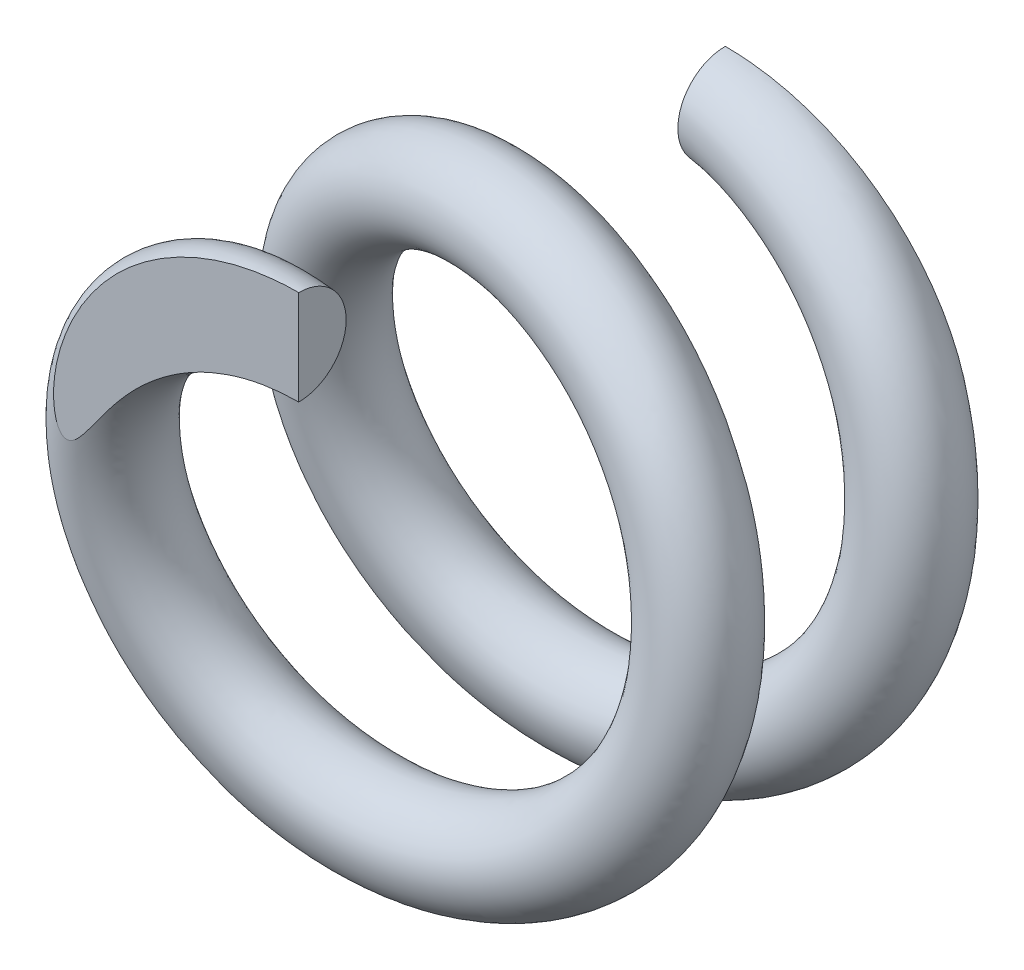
ISO-10303-21;
HEADER;
FILE_DESCRIPTION(('STEP AP214'),'2;1');
FILE_NAME('part.step','',(''),(''),'','','');
FILE_SCHEMA(('AUTOMOTIVE_DESIGN { 1 0 10303 214 1 1 1 1 }'));
ENDSEC;
DATA;
#1=APPLICATION_CONTEXT('core data for automotive mechanical design processes');
#2=APPLICATION_PROTOCOL_DEFINITION('international standard','automotive_design',2000,#1);
#3=PRODUCT_CONTEXT('',#1,'mechanical');
#4=PRODUCT('Part','Part','',(#3));
#5=PRODUCT_RELATED_PRODUCT_CATEGORY('part','',(#4));
#6=PRODUCT_DEFINITION_FORMATION('','',#4);
#7=PRODUCT_DEFINITION_CONTEXT('part definition',#1,'design');
#8=PRODUCT_DEFINITION('design','',#6,#7);
#9=PRODUCT_DEFINITION_SHAPE('','',#8);
#10=(LENGTH_UNIT() NAMED_UNIT(*) SI_UNIT(.MILLI.,.METRE.));
#11=(NAMED_UNIT(*) PLANE_ANGLE_UNIT() SI_UNIT($,.RADIAN.));
#12=(NAMED_UNIT(*) SI_UNIT($,.STERADIAN.) SOLID_ANGLE_UNIT());
#13=UNCERTAINTY_MEASURE_WITH_UNIT(LENGTH_MEASURE(1.E-05),#10,'distance_accuracy_value','');
#14=(GEOMETRIC_REPRESENTATION_CONTEXT(3) GLOBAL_UNCERTAINTY_ASSIGNED_CONTEXT((#13)) GLOBAL_UNIT_ASSIGNED_CONTEXT((#10,
#11,#12)) REPRESENTATION_CONTEXT('',''));
#15=CARTESIAN_POINT('',(0.,0.,0.));
#16=DIRECTION('',(0.,0.,1.));
#17=DIRECTION('',(1.,0.,0.));
#18=AXIS2_PLACEMENT_3D('',#15,#16,#17);
#19=CARTESIAN_POINT('',(0.,5.,1.));
#20=DIRECTION('',(-1.,0.,0.));
#21=DIRECTION('',(0.,0.,1.));
#22=AXIS2_PLACEMENT_3D('',#19,#20,#21);
#23=PLANE('',#22);
#24=CARTESIAN_POINT('',(0.,6.,0.));
#25=CARTESIAN_POINT('',(0.,6.00000014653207,0.0132155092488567));
#26=CARTESIAN_POINT('',(0.,5.99973803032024,0.0264310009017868));
#27=CARTESIAN_POINT('',(0.,5.998695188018,0.0527187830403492));
#28=CARTESIAN_POINT('',(0.,5.99791929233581,0.065791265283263));
#29=CARTESIAN_POINT('',(0.,5.99586503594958,0.0917652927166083));
#30=CARTESIAN_POINT('',(0.,5.99459177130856,0.104667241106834));
#31=CARTESIAN_POINT('',(0.,5.99156090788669,0.130274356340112));
#32=CARTESIAN_POINT('',(0.,5.98980862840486,0.142980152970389));
#33=CARTESIAN_POINT('',(0.,5.98583934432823,0.168171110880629));
#34=CARTESIAN_POINT('',(0.,5.9836278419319,0.180657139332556));
#35=CARTESIAN_POINT('',(0.,5.97876103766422,0.205386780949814));
#36=CARTESIAN_POINT('',(0.,5.97611137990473,0.217631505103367));
#37=CARTESIAN_POINT('',(0.,5.97039025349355,0.241858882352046));
#38=CARTESIAN_POINT('',(0.,5.96732453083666,0.253842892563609));
#39=CARTESIAN_POINT('',(0.,5.96079410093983,0.277531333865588));
#40=CARTESIAN_POINT('',(0.,5.95733520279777,0.289237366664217));
#41=CARTESIAN_POINT('',(0.,5.95004186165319,0.312354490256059));
#42=CARTESIAN_POINT('',(0.,5.94621325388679,0.32376742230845));
#43=CARTESIAN_POINT('',(0.,5.93820433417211,0.346285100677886));
#44=CARTESIAN_POINT('',(0.,5.93402984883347,0.357391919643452));
#45=CARTESIAN_POINT('',(0.,5.92535321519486,0.379286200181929));
#46=CARTESIAN_POINT('',(0.,5.9208568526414,0.390075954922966));
#47=CARTESIAN_POINT('',(0.,5.91156052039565,0.41132694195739));
#48=CARTESIAN_POINT('',(0.,5.90676626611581,0.421790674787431));
#49=CARTESIAN_POINT('',(0.,5.89689805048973,0.442382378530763));
#50=CARTESIAN_POINT('',(0.,5.89182970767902,0.452513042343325));
#51=CARTESIAN_POINT('',(0.,5.88143690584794,0.472433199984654));
#52=CARTESIAN_POINT('',(0.,5.87611794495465,0.4822255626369));
#53=CARTESIAN_POINT('',(0.,5.86524705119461,0.501465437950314));
#54=CARTESIAN_POINT('',(0.,5.85970047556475,0.510915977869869));
#55=CARTESIAN_POINT('',(0.,5.84839693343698,0.529470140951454));
#56=CARTESIAN_POINT('',(0.,5.84264516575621,0.53857693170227));
#57=CARTESIAN_POINT('',(0.,5.83095314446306,0.556443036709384));
#58=CARTESIAN_POINT('',(0.,5.82501791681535,0.56520564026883));
#59=CARTESIAN_POINT('',(0.,5.81298015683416,0.582384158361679));
#60=CARTESIAN_POINT('',(0.,5.80688246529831,0.590803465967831));
#61=CARTESIAN_POINT('',(0.,5.79454002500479,0.607297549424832));
#62=CARTESIAN_POINT('',(0.,5.7882999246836,0.615375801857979));
#63=CARTESIAN_POINT('',(0.,5.77569243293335,0.63119065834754));
#64=CARTESIAN_POINT('',(0.,5.76932948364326,0.638930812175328));
#65=CARTESIAN_POINT('',(0.,5.75025758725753,0.661432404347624));
#66=CARTESIAN_POINT('',(0.,5.73722817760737,0.675924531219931));
#67=CARTESIAN_POINT('',(0.,5.71085502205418,0.703588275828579));
#68=CARTESIAN_POINT('',(0.,5.69754184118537,0.716789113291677));
#69=CARTESIAN_POINT('',(0.,5.6707229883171,0.741926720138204));
#70=CARTESIAN_POINT('',(0.,5.6572446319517,0.753892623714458));
#71=CARTESIAN_POINT('',(0.,5.63020317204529,0.776623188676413));
#72=CARTESIAN_POINT('',(0.,5.61666420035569,0.787416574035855));
#73=CARTESIAN_POINT('',(0.,5.58959404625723,0.807870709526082));
#74=CARTESIAN_POINT('',(0.,5.57608400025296,0.817559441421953));
#75=CARTESIAN_POINT('',(0.,5.54915034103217,0.835875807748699));
#76=CARTESIAN_POINT('',(0.,5.53574508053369,0.844530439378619));
#77=CARTESIAN_POINT('',(0.,5.50908672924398,0.860851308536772));
#78=CARTESIAN_POINT('',(0.,5.49584944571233,0.868543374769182));
#79=CARTESIAN_POINT('',(0.,5.46958111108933,0.883011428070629));
#80=CARTESIAN_POINT('',(0.,5.45656356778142,0.889811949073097));
#81=CARTESIAN_POINT('',(0.,5.43077834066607,0.902567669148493));
#82=CARTESIAN_POINT('',(0.,5.41802210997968,0.908546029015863));
#83=CARTESIAN_POINT('',(0.,5.39279393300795,0.919725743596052));
#84=CARTESIAN_POINT('',(0.,5.38033162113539,0.924948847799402));
#85=CARTESIAN_POINT('',(0.,5.35571768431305,0.934683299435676));
#86=CARTESIAN_POINT('',(0.,5.34357409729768,0.939214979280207));
#87=CARTESIAN_POINT('',(0.,5.3196170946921,0.947628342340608));
#88=CARTESIAN_POINT('',(0.,5.3078103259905,0.951528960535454));
#89=CARTESIAN_POINT('',(0.,5.28454053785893,0.958738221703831));
#90=CARTESIAN_POINT('',(0.,5.27308296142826,0.962064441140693));
#91=CARTESIAN_POINT('',(0.,5.25052014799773,0.96817907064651));
#92=CARTESIAN_POINT('',(0.,5.23941931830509,0.970983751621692));
#93=CARTESIAN_POINT('',(0.,5.21757439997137,0.976105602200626));
#94=CARTESIAN_POINT('',(0.,5.20683383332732,0.978437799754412));
#95=CARTESIAN_POINT('',(0.,5.18571042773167,0.982661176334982));
#96=CARTESIAN_POINT('',(0.,5.17533035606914,0.984566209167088));
#97=CARTESIAN_POINT('',(0.,5.15492594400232,0.987978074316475));
#98=CARTESIAN_POINT('',(0.,5.14490373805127,0.989497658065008));
#99=CARTESIAN_POINT('',(0.,5.1252113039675,0.992177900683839));
#100=CARTESIAN_POINT('',(0.,5.11554265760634,0.993350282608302));
#101=CARTESIAN_POINT('',(0.,5.08760090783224,0.996324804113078));
#102=CARTESIAN_POINT('',(0.,5.06928790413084,0.997765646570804));
#103=CARTESIAN_POINT('',(0.,5.03398087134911,0.999566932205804));
#104=CARTESIAN_POINT('',(0.,5.01699043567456,1.));
#105=CARTESIAN_POINT('',(0.,4.98300956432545,1.));
#106=CARTESIAN_POINT('',(0.,4.96601912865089,0.999566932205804));
#107=CARTESIAN_POINT('',(0.,4.93071209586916,0.997765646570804));
#108=CARTESIAN_POINT('',(0.,4.91239909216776,0.996324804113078));
#109=CARTESIAN_POINT('',(0.,4.88445734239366,0.993350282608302));
#110=CARTESIAN_POINT('',(0.,4.8747886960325,0.992177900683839));
#111=CARTESIAN_POINT('',(0.,4.85509626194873,0.989497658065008));
#112=CARTESIAN_POINT('',(0.,4.84507405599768,0.987978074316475));
#113=CARTESIAN_POINT('',(0.,4.82466964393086,0.984566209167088));
#114=CARTESIAN_POINT('',(0.,4.81428957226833,0.982661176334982));
#115=CARTESIAN_POINT('',(0.,4.79316616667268,0.978437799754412));
#116=CARTESIAN_POINT('',(0.,4.78242560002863,0.976105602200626));
#117=CARTESIAN_POINT('',(0.,4.76058068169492,0.970983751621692));
#118=CARTESIAN_POINT('',(0.,4.74947985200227,0.96817907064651));
#119=CARTESIAN_POINT('',(0.,4.72691703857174,0.962064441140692));
#120=CARTESIAN_POINT('',(0.,4.71545946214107,0.958738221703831));
#121=CARTESIAN_POINT('',(0.,4.6921896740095,0.951528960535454));
#122=CARTESIAN_POINT('',(0.,4.6803829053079,0.947628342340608));
#123=CARTESIAN_POINT('',(0.,4.65642590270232,0.939214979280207));
#124=CARTESIAN_POINT('',(0.,4.64428231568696,0.934683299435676));
#125=CARTESIAN_POINT('',(0.,4.61966837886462,0.924948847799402));
#126=CARTESIAN_POINT('',(0.,4.60720606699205,0.919725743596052));
#127=CARTESIAN_POINT('',(0.,4.58197789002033,0.908546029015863));
#128=CARTESIAN_POINT('',(0.,4.56922165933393,0.902567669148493));
#129=CARTESIAN_POINT('',(0.,4.54343643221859,0.889811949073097));
#130=CARTESIAN_POINT('',(0.,4.53041888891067,0.88301142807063));
#131=CARTESIAN_POINT('',(0.,4.50415055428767,0.868543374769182));
#132=CARTESIAN_POINT('',(0.,4.49091327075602,0.860851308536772));
#133=CARTESIAN_POINT('',(0.,4.46425491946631,0.844530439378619));
#134=CARTESIAN_POINT('',(0.,4.45084965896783,0.835875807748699));
#135=CARTESIAN_POINT('',(0.,4.42391599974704,0.817559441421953));
#136=CARTESIAN_POINT('',(0.,4.41040595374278,0.807870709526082));
#137=CARTESIAN_POINT('',(0.,4.38333579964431,0.787416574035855));
#138=CARTESIAN_POINT('',(0.,4.36979682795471,0.776623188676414));
#139=CARTESIAN_POINT('',(0.,4.3427553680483,0.753892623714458));
#140=CARTESIAN_POINT('',(0.,4.32927701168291,0.741926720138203));
#141=CARTESIAN_POINT('',(0.,4.30245815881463,0.716789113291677));
#142=CARTESIAN_POINT('',(0.,4.28914497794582,0.703588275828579));
#143=CARTESIAN_POINT('',(0.,4.26277182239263,0.675924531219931));
#144=CARTESIAN_POINT('',(0.,4.24974241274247,0.661432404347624));
#145=CARTESIAN_POINT('',(0.,4.23067051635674,0.638930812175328));
#146=CARTESIAN_POINT('',(0.,4.22430756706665,0.63119065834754));
#147=CARTESIAN_POINT('',(0.,4.2117000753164,0.615375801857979));
#148=CARTESIAN_POINT('',(0.,4.20545997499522,0.607297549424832));
#149=CARTESIAN_POINT('',(0.,4.19311753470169,0.590803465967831));
#150=CARTESIAN_POINT('',(0.,4.18701984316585,0.582384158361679));
#151=CARTESIAN_POINT('',(0.,4.17498208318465,0.56520564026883));
#152=CARTESIAN_POINT('',(0.,4.16904685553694,0.556443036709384));
#153=CARTESIAN_POINT('',(0.,4.15735483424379,0.53857693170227));
#154=CARTESIAN_POINT('',(0.,4.15160306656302,0.529470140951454));
#155=CARTESIAN_POINT('',(0.,4.14029952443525,0.510915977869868));
#156=CARTESIAN_POINT('',(0.,4.13475294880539,0.501465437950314));
#157=CARTESIAN_POINT('',(0.,4.12388205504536,0.482225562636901));
#158=CARTESIAN_POINT('',(0.,4.11856309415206,0.472433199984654));
#159=CARTESIAN_POINT('',(0.,4.10817029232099,0.452513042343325));
#160=CARTESIAN_POINT('',(0.,4.10310194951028,0.442382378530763));
#161=CARTESIAN_POINT('',(0.,4.09323373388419,0.42179067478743));
#162=CARTESIAN_POINT('',(0.,4.08843947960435,0.41132694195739));
#163=CARTESIAN_POINT('',(0.,4.0791431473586,0.390075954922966));
#164=CARTESIAN_POINT('',(0.,4.07464678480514,0.379286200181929));
#165=CARTESIAN_POINT('',(0.,4.06597015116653,0.357391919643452));
#166=CARTESIAN_POINT('',(0.,4.06179566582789,0.346285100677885));
#167=CARTESIAN_POINT('',(0.,4.05378674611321,0.32376742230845));
#168=CARTESIAN_POINT('',(0.,4.04995813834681,0.312354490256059));
#169=CARTESIAN_POINT('',(0.,4.04266479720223,0.289237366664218));
#170=CARTESIAN_POINT('',(0.,4.03920589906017,0.277531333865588));
#171=CARTESIAN_POINT('',(0.,4.03267546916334,0.253842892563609));
#172=CARTESIAN_POINT('',(0.,4.02960974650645,0.241858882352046));
#173=CARTESIAN_POINT('',(0.,4.02388862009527,0.217631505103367));
#174=CARTESIAN_POINT('',(0.,4.02123896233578,0.205386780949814));
#175=CARTESIAN_POINT('',(0.,4.0163721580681,0.180657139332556));
#176=CARTESIAN_POINT('',(0.,4.01416065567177,0.168171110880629));
#177=CARTESIAN_POINT('',(0.,4.01019137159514,0.142980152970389));
#178=CARTESIAN_POINT('',(0.,4.00843909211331,0.130274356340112));
#179=CARTESIAN_POINT('',(0.,4.00540822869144,0.104667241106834));
#180=CARTESIAN_POINT('',(0.,4.00413496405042,0.0917652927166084));
#181=CARTESIAN_POINT('',(0.,4.00208070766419,0.065791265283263));
#182=CARTESIAN_POINT('',(0.,4.001304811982,0.0527187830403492));
#183=CARTESIAN_POINT('',(0.,4.00026196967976,0.0264310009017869));
#184=CARTESIAN_POINT('',(0.,3.99999985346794,0.0132155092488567));
#185=CARTESIAN_POINT('',(0.,4.,0.));
#186=B_SPLINE_CURVE_WITH_KNOTS('',3,(#24,#25,#26,#27,#28,#29,#30,#31,#32,#33,#34,#35,#36,#37,
#38,#39,#40,#41,#42,#43,#44,#45,#46,#47,#48,#49,#50,#51,#52,#53,#54,#55,#56,#57,#58,#59,#60,#61,
#62,#63,#64,#65,#66,#67,#68,#69,#70,#71,#72,#73,#74,#75,#76,#77,#78,#79,#80,#81,#82,#83,#84,#85,
#86,#87,#88,#89,#90,#91,#92,#93,#94,#95,#96,#97,#98,#99,#100,#101,#102,#103,#104,#105,#106,#107,
#108,#109,#110,#111,#112,#113,#114,#115,#116,#117,#118,#119,#120,#121,#122,#123,#124,#125,#126,
#127,#128,#129,#130,#131,#132,#133,#134,#135,#136,#137,#138,#139,#140,#141,#142,#143,#144,#145,
#146,#147,#148,#149,#150,#151,#152,#153,#154,#155,#156,#157,#158,#159,#160,#161,#162,#163,#164,
#165,#166,#167,#168,#169,#170,#171,#172,#173,#174,#175,#176,#177,#178,#179,#180,#181,#182,#183,
#184,#185),.UNSPECIFIED.,.F.,.F.,(4,2,2,2,2,2,2,2,2,2,2,2,2,2,2,2,2,2,2,2,2,2,2,2,2,2,2,2,2,2,2,
2,2,2,2,2,2,2,2,2,2,2,2,2,2,2,2,2,2,2,2,2,2,2,2,2,2,2,2,2,2,2,2,2,2,2,2,2,2,2,2,2,2,2,2,2,2,2,2,
2,4),(0.,0.039643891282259,0.078920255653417,0.117804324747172,0.156273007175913,
0.194304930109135,0.231880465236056,0.268981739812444,0.305592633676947,0.341698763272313,
0.37728745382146,0.412347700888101,0.44687012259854,0.480846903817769,0.514271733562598,
0.547139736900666,0.579447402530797,0.611192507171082,0.642374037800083,0.672992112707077,
0.70304790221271,0.761475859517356,0.817692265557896,0.87173644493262,0.923657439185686,
0.973511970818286,1.02136262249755,1.06727623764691,1.1113225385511,1.15357295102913,
1.1940996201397,1.23297459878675,1.2702691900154,1.30605342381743,1.34039565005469,
1.37336223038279,1.40501731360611,1.43542268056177,1.46463764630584,1.51971581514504,
1.5706822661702,1.62164871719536,1.67672688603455,1.70594185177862,1.73634721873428,
1.76800230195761,1.8009688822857,1.83531110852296,1.871095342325,1.90838993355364,
1.94726491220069,1.98779158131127,2.0300419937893,2.07408829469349,2.12000190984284,
2.16785256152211,2.21770709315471,2.26962808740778,2.3236722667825,2.37988867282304,
2.43831663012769,2.46837241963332,2.49899049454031,2.53017202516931,2.5619171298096,
2.59422479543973,2.6270927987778,2.66051762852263,2.69449440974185,2.72901683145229,
2.76407707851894,2.79966576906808,2.83577189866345,2.87238279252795,2.90948406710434,
2.94705960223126,2.98509152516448,3.02356020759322,3.06244427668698,3.10172064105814,
3.1413645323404),.UNSPECIFIED.);
#187=CARTESIAN_POINT('',(0.,6.,0.));
#188=VERTEX_POINT('',#187);
#189=CARTESIAN_POINT('',(0.,4.,0.));
#190=VERTEX_POINT('',#189);
#191=EDGE_CURVE('E63',#188,#190,#186,.T.);
#192=ORIENTED_EDGE('',*,*,#191,.F.);
#193=DIRECTION('',(0.,-1.,0.));
#194=VECTOR('',#193,1.);
#195=CARTESIAN_POINT('',(0.,5.,0.));
#196=LINE('',#195,#194);
#197=EDGE_CURVE('E51',#188,#190,#196,.T.);
#198=ORIENTED_EDGE('',*,*,#197,.T.);
#199=EDGE_LOOP('',(#192,#198));
#200=FACE_BOUND('',#199,.T.);
#201=ADVANCED_FACE('F24',(#200),#23,.T.);
#202=CARTESIAN_POINT('',(0.,5.,10.));
#203=DIRECTION('',(-1.,0.,0.));
#204=DIRECTION('',(0.,-1.,0.));
#205=AXIS2_PLACEMENT_3D('',#202,#203,#204);
#206=PLANE('',#205);
#207=DIRECTION('',(0.,1.,0.));
#208=VECTOR('',#207,1.);
#209=CARTESIAN_POINT('',(0.,5.,9.));
#210=LINE('',#209,#208);
#211=CARTESIAN_POINT('',(0.,4.,9.));
#212=VERTEX_POINT('',#211);
#213=CARTESIAN_POINT('',(0.,6.,9.));
#214=VERTEX_POINT('',#213);
#215=EDGE_CURVE('E45',#212,#214,#210,.T.);
#216=ORIENTED_EDGE('',*,*,#215,.F.);
#217=CARTESIAN_POINT('',(0.,5.,8.));
#218=CARTESIAN_POINT('',(0.,4.73841681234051,8.));
#219=CARTESIAN_POINT('',(0.,4.,8.15047207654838));
#220=CARTESIAN_POINT('',(0.,4.,9.84952792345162));
#221=CARTESIAN_POINT('',(0.,4.73841681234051,10.));
#222=CARTESIAN_POINT('',(0.,5.26158318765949,10.));
#223=CARTESIAN_POINT('',(0.,6.,9.84952792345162));
#224=CARTESIAN_POINT('',(0.,6.,8.15047207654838));
#225=CARTESIAN_POINT('',(0.,5.26158318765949,8.));
#226=CARTESIAN_POINT('',(0.,5.,8.));
#227=(BOUNDED_CURVE() B_SPLINE_CURVE(3,(#217,#218,#219,#220,#221,#222,#223,#224,#225,#226),
.UNSPECIFIED.,.T.,.F.) B_SPLINE_CURVE_WITH_KNOTS((4,2,2,2,4),(0.,0.25,0.5,0.75,1.),
.UNSPECIFIED.) CURVE() GEOMETRIC_REPRESENTATION_ITEM() RATIONAL_B_SPLINE_CURVE((1.,1.,
0.68211091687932,0.68211091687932,1.,1.,0.68211091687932,0.68211091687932,1.,1.)) REPRESENTATION_ITEM(''));
#228=EDGE_CURVE('E60',#214,#212,#227,.T.);
#229=ORIENTED_EDGE('',*,*,#228,.F.);
#230=EDGE_LOOP('',(#216,#229));
#231=FACE_BOUND('',#230,.T.);
#232=ADVANCED_FACE('F26',(#231),#206,.F.);
#233=CARTESIAN_POINT('',(0.,5.,-1.));
#234=CARTESIAN_POINT('',(1.33974596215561,5.,-0.8125));
#235=CARTESIAN_POINT('',(2.5,4.3301270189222,-0.625));
#236=CARTESIAN_POINT('',(3.66025403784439,3.66025403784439,-0.4375));
#237=CARTESIAN_POINT('',(4.33012701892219,2.5,-0.25));
#238=CARTESIAN_POINT('',(5.,1.33974596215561,-0.0625000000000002));
#239=CARTESIAN_POINT('',(5.,0.,0.125));
#240=CARTESIAN_POINT('',(5.,-1.33974596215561,0.3125));
#241=CARTESIAN_POINT('',(4.3301270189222,-2.5,0.5));
#242=CARTESIAN_POINT('',(3.66025403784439,-3.66025403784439,0.6875));
#243=CARTESIAN_POINT('',(2.5,-4.33012701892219,0.875));
#244=CARTESIAN_POINT('',(1.33974596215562,-5.,1.0625));
#245=CARTESIAN_POINT('',(0.,-5.,1.25));
#246=CARTESIAN_POINT('',(-1.33974596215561,-5.,1.4375));
#247=CARTESIAN_POINT('',(-2.5,-4.3301270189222,1.625));
#248=CARTESIAN_POINT('',(-3.66025403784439,-3.66025403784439,1.8125));
#249=CARTESIAN_POINT('',(-4.33012701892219,-2.5,2.));
#250=CARTESIAN_POINT('',(-5.,-1.33974596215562,2.1875));
#251=CARTESIAN_POINT('',(-5.,0.,2.375));
#252=CARTESIAN_POINT('',(-5.,1.33974596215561,2.5625));
#253=CARTESIAN_POINT('',(-4.3301270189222,2.5,2.75));
#254=CARTESIAN_POINT('',(-3.66025403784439,3.66025403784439,2.9375));
#255=CARTESIAN_POINT('',(-2.5,4.33012701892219,3.125));
#256=CARTESIAN_POINT('',(-1.33974596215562,5.,3.3125));
#257=CARTESIAN_POINT('',(0.,5.,3.5));
#258=CARTESIAN_POINT('',(1.33974596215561,5.,3.6875));
#259=CARTESIAN_POINT('',(2.5,4.3301270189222,3.875));
#260=CARTESIAN_POINT('',(3.66025403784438,3.66025403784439,4.0625));
#261=CARTESIAN_POINT('',(4.33012701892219,2.5,4.25));
#262=CARTESIAN_POINT('',(5.,1.33974596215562,4.4375));
#263=CARTESIAN_POINT('',(5.,0.,4.625));
#264=CARTESIAN_POINT('',(5.,-1.33974596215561,4.8125));
#265=CARTESIAN_POINT('',(4.3301270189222,-2.5,5.));
#266=CARTESIAN_POINT('',(3.66025403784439,-3.66025403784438,5.1875));
#267=CARTESIAN_POINT('',(2.50000000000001,-4.33012701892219,5.375));
#268=CARTESIAN_POINT('',(1.33974596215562,-5.,5.5625));
#269=CARTESIAN_POINT('',(0.,-5.,5.75));
#270=CARTESIAN_POINT('',(-1.33974596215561,-5.,5.9375));
#271=CARTESIAN_POINT('',(-2.5,-4.3301270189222,6.125));
#272=CARTESIAN_POINT('',(-3.66025403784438,-3.66025403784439,6.3125));
#273=CARTESIAN_POINT('',(-4.33012701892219,-2.50000000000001,6.5));
#274=CARTESIAN_POINT('',(-5.,-1.33974596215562,6.6875));
#275=CARTESIAN_POINT('',(-5.,0.,6.875));
#276=CARTESIAN_POINT('',(-5.,1.33974596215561,7.0625));
#277=CARTESIAN_POINT('',(-4.3301270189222,2.5,7.25));
#278=CARTESIAN_POINT('',(-3.66025403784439,3.66025403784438,7.4375));
#279=CARTESIAN_POINT('',(-2.50000000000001,4.33012701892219,7.625));
#280=CARTESIAN_POINT('',(-1.33974596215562,5.,7.8125));
#281=CARTESIAN_POINT('',(0.,5.,8.));
#282=CARTESIAN_POINT('',(0.,5.26158318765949,-1.));
#283=CARTESIAN_POINT('',(1.40983696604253,5.26158318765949,-0.8125));
#284=CARTESIAN_POINT('',(2.63079159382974,4.55666470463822,-0.625));
#285=CARTESIAN_POINT('',(3.85174622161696,3.85174622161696,-0.4375));
#286=CARTESIAN_POINT('',(4.55666470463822,2.63079159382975,-0.25));
#287=CARTESIAN_POINT('',(5.26158318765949,1.40983696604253,-0.0625000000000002));
#288=CARTESIAN_POINT('',(5.26158318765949,0.,0.125));
#289=CARTESIAN_POINT('',(5.26158318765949,-1.40983696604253,0.3125));
#290=CARTESIAN_POINT('',(4.55666470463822,-2.63079159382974,0.5));
#291=CARTESIAN_POINT('',(3.85174622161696,-3.85174622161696,0.6875));
#292=CARTESIAN_POINT('',(2.63079159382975,-4.55666470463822,0.875));
#293=CARTESIAN_POINT('',(1.40983696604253,-5.26158318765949,1.0625));
#294=CARTESIAN_POINT('',(0.,-5.26158318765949,1.25));
#295=CARTESIAN_POINT('',(-1.40983696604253,-5.26158318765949,1.4375));
#296=CARTESIAN_POINT('',(-2.63079159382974,-4.55666470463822,1.625));
#297=CARTESIAN_POINT('',(-3.85174622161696,-3.85174622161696,1.8125));
#298=CARTESIAN_POINT('',(-4.55666470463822,-2.63079159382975,2.));
#299=CARTESIAN_POINT('',(-5.26158318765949,-1.40983696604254,2.1875));
#300=CARTESIAN_POINT('',(-5.26158318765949,0.,2.375));
#301=CARTESIAN_POINT('',(-5.26158318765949,1.40983696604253,2.5625));
#302=CARTESIAN_POINT('',(-4.55666470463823,2.63079159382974,2.75));
#303=CARTESIAN_POINT('',(-3.85174622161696,3.85174622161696,2.9375));
#304=CARTESIAN_POINT('',(-2.63079159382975,4.55666470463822,3.125));
#305=CARTESIAN_POINT('',(-1.40983696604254,5.26158318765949,3.3125));
#306=CARTESIAN_POINT('',(0.,5.26158318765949,3.5));
#307=CARTESIAN_POINT('',(1.40983696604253,5.26158318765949,3.6875));
#308=CARTESIAN_POINT('',(2.63079159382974,4.55666470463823,3.875));
#309=CARTESIAN_POINT('',(3.85174622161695,3.85174622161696,4.0625));
#310=CARTESIAN_POINT('',(4.55666470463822,2.63079159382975,4.25));
#311=CARTESIAN_POINT('',(5.26158318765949,1.40983696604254,4.4375));
#312=CARTESIAN_POINT('',(5.26158318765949,0.,4.625));
#313=CARTESIAN_POINT('',(5.26158318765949,-1.40983696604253,4.8125));
#314=CARTESIAN_POINT('',(4.55666470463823,-2.63079159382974,5.));
#315=CARTESIAN_POINT('',(3.85174622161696,-3.85174622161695,5.1875));
#316=CARTESIAN_POINT('',(2.63079159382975,-4.55666470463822,5.375));
#317=CARTESIAN_POINT('',(1.40983696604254,-5.26158318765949,5.5625));
#318=CARTESIAN_POINT('',(0.,-5.26158318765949,5.75));
#319=CARTESIAN_POINT('',(-1.40983696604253,-5.26158318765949,5.9375));
#320=CARTESIAN_POINT('',(-2.63079159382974,-4.55666470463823,6.125));
#321=CARTESIAN_POINT('',(-3.85174622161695,-3.85174622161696,6.3125));
#322=CARTESIAN_POINT('',(-4.55666470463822,-2.63079159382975,6.5));
#323=CARTESIAN_POINT('',(-5.26158318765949,-1.40983696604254,6.6875));
#324=CARTESIAN_POINT('',(-5.26158318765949,0.,6.875));
#325=CARTESIAN_POINT('',(-5.26158318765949,1.40983696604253,7.0625));
#326=CARTESIAN_POINT('',(-4.55666470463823,2.63079159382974,7.25));
#327=CARTESIAN_POINT('',(-3.85174622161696,3.85174622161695,7.4375));
#328=CARTESIAN_POINT('',(-2.63079159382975,4.55666470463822,7.625));
#329=CARTESIAN_POINT('',(-1.40983696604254,5.26158318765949,7.8125));
#330=CARTESIAN_POINT('',(0.,5.26158318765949,8.));
#331=CARTESIAN_POINT('',(0.,6.,-0.849527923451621));
#332=CARTESIAN_POINT('',(1.60769515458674,6.,-0.662027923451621));
#333=CARTESIAN_POINT('',(3.,5.19615242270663,-0.474527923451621));
#334=CARTESIAN_POINT('',(4.39230484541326,4.39230484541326,-0.287027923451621));
#335=CARTESIAN_POINT('',(5.19615242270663,3.,-0.0995279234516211));
#336=CARTESIAN_POINT('',(6.,1.60769515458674,0.0879720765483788));
#337=CARTESIAN_POINT('',(6.,0.,0.275472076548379));
#338=CARTESIAN_POINT('',(6.,-1.60769515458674,0.462972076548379));
#339=CARTESIAN_POINT('',(5.19615242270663,-3.,0.650472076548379));
#340=CARTESIAN_POINT('',(4.39230484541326,-4.39230484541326,0.837972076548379));
#341=CARTESIAN_POINT('',(3.,-5.19615242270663,1.02547207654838));
#342=CARTESIAN_POINT('',(1.60769515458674,-6.,1.21297207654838));
#343=CARTESIAN_POINT('',(0.,-6.,1.40047207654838));
#344=CARTESIAN_POINT('',(-1.60769515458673,-6.,1.58797207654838));
#345=CARTESIAN_POINT('',(-3.,-5.19615242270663,1.77547207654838));
#346=CARTESIAN_POINT('',(-4.39230484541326,-4.39230484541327,1.96297207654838));
#347=CARTESIAN_POINT('',(-5.19615242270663,-3.,2.15047207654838));
#348=CARTESIAN_POINT('',(-6.,-1.60769515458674,2.33797207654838));
#349=CARTESIAN_POINT('',(-6.,0.,2.52547207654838));
#350=CARTESIAN_POINT('',(-6.,1.60769515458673,2.71297207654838));
#351=CARTESIAN_POINT('',(-5.19615242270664,3.,2.90047207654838));
#352=CARTESIAN_POINT('',(-4.39230484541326,4.39230484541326,3.08797207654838));
#353=CARTESIAN_POINT('',(-3.,5.19615242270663,3.27547207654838));
#354=CARTESIAN_POINT('',(-1.60769515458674,6.,3.46297207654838));
#355=CARTESIAN_POINT('',(0.,6.,3.65047207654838));
#356=CARTESIAN_POINT('',(1.60769515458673,6.,3.83797207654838));
#357=CARTESIAN_POINT('',(3.,5.19615242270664,4.02547207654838));
#358=CARTESIAN_POINT('',(4.39230484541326,4.39230484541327,4.21297207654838));
#359=CARTESIAN_POINT('',(5.19615242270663,3.,4.40047207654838));
#360=CARTESIAN_POINT('',(6.,1.60769515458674,4.58797207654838));
#361=CARTESIAN_POINT('',(6.,0.,4.77547207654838));
#362=CARTESIAN_POINT('',(6.,-1.60769515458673,4.96297207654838));
#363=CARTESIAN_POINT('',(5.19615242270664,-3.,5.15047207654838));
#364=CARTESIAN_POINT('',(4.39230484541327,-4.39230484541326,5.33797207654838));
#365=CARTESIAN_POINT('',(3.00000000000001,-5.19615242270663,5.52547207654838));
#366=CARTESIAN_POINT('',(1.60769515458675,-6.,5.71297207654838));
#367=CARTESIAN_POINT('',(0.,-6.,5.90047207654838));
#368=CARTESIAN_POINT('',(-1.60769515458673,-6.,6.08797207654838));
#369=CARTESIAN_POINT('',(-3.,-5.19615242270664,6.27547207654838));
#370=CARTESIAN_POINT('',(-4.39230484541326,-4.39230484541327,6.46297207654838));
#371=CARTESIAN_POINT('',(-5.19615242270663,-3.00000000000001,6.65047207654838));
#372=CARTESIAN_POINT('',(-6.,-1.60769515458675,6.83797207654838));
#373=CARTESIAN_POINT('',(-6.,0.,7.02547207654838));
#374=CARTESIAN_POINT('',(-6.,1.60769515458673,7.21297207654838));
#375=CARTESIAN_POINT('',(-5.19615242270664,3.,7.40047207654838));
#376=CARTESIAN_POINT('',(-4.39230484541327,4.39230484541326,7.58797207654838));
#377=CARTESIAN_POINT('',(-3.00000000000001,5.19615242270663,7.77547207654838));
#378=CARTESIAN_POINT('',(-1.60769515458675,6.,7.96297207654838));
#379=CARTESIAN_POINT('',(0.,6.,8.15047207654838));
#380=CARTESIAN_POINT('',(0.,6.,0.849527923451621));
#381=CARTESIAN_POINT('',(1.60769515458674,6.,1.03702792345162));
#382=CARTESIAN_POINT('',(3.,5.19615242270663,1.22452792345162));
#383=CARTESIAN_POINT('',(4.39230484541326,4.39230484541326,1.41202792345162));
#384=CARTESIAN_POINT('',(5.19615242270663,3.,1.59952792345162));
#385=CARTESIAN_POINT('',(6.,1.60769515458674,1.78702792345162));
#386=CARTESIAN_POINT('',(6.,0.,1.97452792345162));
#387=CARTESIAN_POINT('',(6.,-1.60769515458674,2.16202792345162));
#388=CARTESIAN_POINT('',(5.19615242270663,-3.,2.34952792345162));
#389=CARTESIAN_POINT('',(4.39230484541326,-4.39230484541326,2.53702792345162));
#390=CARTESIAN_POINT('',(3.,-5.19615242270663,2.72452792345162));
#391=CARTESIAN_POINT('',(1.60769515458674,-6.,2.91202792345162));
#392=CARTESIAN_POINT('',(0.,-6.,3.09952792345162));
#393=CARTESIAN_POINT('',(-1.60769515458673,-6.,3.28702792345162));
#394=CARTESIAN_POINT('',(-3.,-5.19615242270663,3.47452792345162));
#395=CARTESIAN_POINT('',(-4.39230484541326,-4.39230484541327,3.66202792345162));
#396=CARTESIAN_POINT('',(-5.19615242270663,-3.,3.84952792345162));
#397=CARTESIAN_POINT('',(-6.,-1.60769515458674,4.03702792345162));
#398=CARTESIAN_POINT('',(-6.,0.,4.22452792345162));
#399=CARTESIAN_POINT('',(-6.,1.60769515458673,4.41202792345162));
#400=CARTESIAN_POINT('',(-5.19615242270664,3.,4.59952792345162));
#401=CARTESIAN_POINT('',(-4.39230484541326,4.39230484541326,4.78702792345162));
#402=CARTESIAN_POINT('',(-3.,5.19615242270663,4.97452792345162));
#403=CARTESIAN_POINT('',(-1.60769515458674,6.,5.16202792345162));
#404=CARTESIAN_POINT('',(0.,6.,5.34952792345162));
#405=CARTESIAN_POINT('',(1.60769515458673,6.,5.53702792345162));
#406=CARTESIAN_POINT('',(3.,5.19615242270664,5.72452792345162));
#407=CARTESIAN_POINT('',(4.39230484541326,4.39230484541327,5.91202792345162));
#408=CARTESIAN_POINT('',(5.19615242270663,3.,6.09952792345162));
#409=CARTESIAN_POINT('',(6.,1.60769515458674,6.28702792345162));
#410=CARTESIAN_POINT('',(6.,0.,6.47452792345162));
#411=CARTESIAN_POINT('',(6.,-1.60769515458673,6.66202792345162));
#412=CARTESIAN_POINT('',(5.19615242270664,-3.,6.84952792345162));
#413=CARTESIAN_POINT('',(4.39230484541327,-4.39230484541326,7.03702792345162));
#414=CARTESIAN_POINT('',(3.00000000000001,-5.19615242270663,7.22452792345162));
#415=CARTESIAN_POINT('',(1.60769515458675,-6.,7.41202792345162));
#416=CARTESIAN_POINT('',(0.,-6.,7.59952792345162));
#417=CARTESIAN_POINT('',(-1.60769515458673,-6.,7.78702792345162));
#418=CARTESIAN_POINT('',(-3.,-5.19615242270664,7.97452792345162));
#419=CARTESIAN_POINT('',(-4.39230484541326,-4.39230484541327,8.16202792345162));
#420=CARTESIAN_POINT('',(-5.19615242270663,-3.00000000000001,8.34952792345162));
#421=CARTESIAN_POINT('',(-6.,-1.60769515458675,8.53702792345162));
#422=CARTESIAN_POINT('',(-6.,0.,8.72452792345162));
#423=CARTESIAN_POINT('',(-6.,1.60769515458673,8.91202792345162));
#424=CARTESIAN_POINT('',(-5.19615242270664,3.,9.09952792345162));
#425=CARTESIAN_POINT('',(-4.39230484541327,4.39230484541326,9.28702792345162));
#426=CARTESIAN_POINT('',(-3.00000000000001,5.19615242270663,9.47452792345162));
#427=CARTESIAN_POINT('',(-1.60769515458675,6.,9.66202792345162));
#428=CARTESIAN_POINT('',(0.,6.,9.84952792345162));
#429=CARTESIAN_POINT('',(0.,5.26158318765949,1.));
#430=CARTESIAN_POINT('',(1.40983696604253,5.26158318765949,1.1875));
#431=CARTESIAN_POINT('',(2.63079159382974,4.55666470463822,1.375));
#432=CARTESIAN_POINT('',(3.85174622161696,3.85174622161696,1.5625));
#433=CARTESIAN_POINT('',(4.55666470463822,2.63079159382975,1.75));
#434=CARTESIAN_POINT('',(5.26158318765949,1.40983696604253,1.9375));
#435=CARTESIAN_POINT('',(5.26158318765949,0.,2.125));
#436=CARTESIAN_POINT('',(5.26158318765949,-1.40983696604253,2.3125));
#437=CARTESIAN_POINT('',(4.55666470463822,-2.63079159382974,2.5));
#438=CARTESIAN_POINT('',(3.85174622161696,-3.85174622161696,2.6875));
#439=CARTESIAN_POINT('',(2.63079159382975,-4.55666470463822,2.875));
#440=CARTESIAN_POINT('',(1.40983696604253,-5.26158318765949,3.0625));
#441=CARTESIAN_POINT('',(0.,-5.26158318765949,3.25));
#442=CARTESIAN_POINT('',(-1.40983696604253,-5.26158318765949,3.4375));
#443=CARTESIAN_POINT('',(-2.63079159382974,-4.55666470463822,3.625));
#444=CARTESIAN_POINT('',(-3.85174622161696,-3.85174622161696,3.8125));
#445=CARTESIAN_POINT('',(-4.55666470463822,-2.63079159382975,4.));
#446=CARTESIAN_POINT('',(-5.26158318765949,-1.40983696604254,4.1875));
#447=CARTESIAN_POINT('',(-5.26158318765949,0.,4.375));
#448=CARTESIAN_POINT('',(-5.26158318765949,1.40983696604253,4.5625));
#449=CARTESIAN_POINT('',(-4.55666470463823,2.63079159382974,4.75));
#450=CARTESIAN_POINT('',(-3.85174622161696,3.85174622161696,4.9375));
#451=CARTESIAN_POINT('',(-2.63079159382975,4.55666470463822,5.125));
#452=CARTESIAN_POINT('',(-1.40983696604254,5.26158318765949,5.3125));
#453=CARTESIAN_POINT('',(0.,5.26158318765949,5.5));
#454=CARTESIAN_POINT('',(1.40983696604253,5.26158318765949,5.6875));
#455=CARTESIAN_POINT('',(2.63079159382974,4.55666470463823,5.875));
#456=CARTESIAN_POINT('',(3.85174622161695,3.85174622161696,6.0625));
#457=CARTESIAN_POINT('',(4.55666470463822,2.63079159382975,6.25));
#458=CARTESIAN_POINT('',(5.26158318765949,1.40983696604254,6.4375));
#459=CARTESIAN_POINT('',(5.26158318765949,0.,6.625));
#460=CARTESIAN_POINT('',(5.26158318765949,-1.40983696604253,6.8125));
#461=CARTESIAN_POINT('',(4.55666470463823,-2.63079159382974,7.));
#462=CARTESIAN_POINT('',(3.85174622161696,-3.85174622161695,7.1875));
#463=CARTESIAN_POINT('',(2.63079159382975,-4.55666470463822,7.375));
#464=CARTESIAN_POINT('',(1.40983696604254,-5.26158318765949,7.5625));
#465=CARTESIAN_POINT('',(0.,-5.26158318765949,7.75));
#466=CARTESIAN_POINT('',(-1.40983696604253,-5.26158318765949,7.9375));
#467=CARTESIAN_POINT('',(-2.63079159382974,-4.55666470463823,8.125));
#468=CARTESIAN_POINT('',(-3.85174622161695,-3.85174622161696,8.3125));
#469=CARTESIAN_POINT('',(-4.55666470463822,-2.63079159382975,8.5));
#470=CARTESIAN_POINT('',(-5.26158318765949,-1.40983696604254,8.6875));
#471=CARTESIAN_POINT('',(-5.26158318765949,0.,8.875));
#472=CARTESIAN_POINT('',(-5.26158318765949,1.40983696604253,9.0625));
#473=CARTESIAN_POINT('',(-4.55666470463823,2.63079159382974,9.25));
#474=CARTESIAN_POINT('',(-3.85174622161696,3.85174622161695,9.4375));
#475=CARTESIAN_POINT('',(-2.63079159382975,4.55666470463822,9.625));
#476=CARTESIAN_POINT('',(-1.40983696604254,5.26158318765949,9.8125));
#477=CARTESIAN_POINT('',(0.,5.26158318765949,10.));
#478=CARTESIAN_POINT('',(0.,4.73841681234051,1.));
#479=CARTESIAN_POINT('',(1.26965495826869,4.73841681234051,1.1875));
#480=CARTESIAN_POINT('',(2.36920840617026,4.10358933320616,1.375));
#481=CARTESIAN_POINT('',(3.46876185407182,3.46876185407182,1.5625));
#482=CARTESIAN_POINT('',(4.10358933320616,2.36920840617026,1.75));
#483=CARTESIAN_POINT('',(4.73841681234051,1.2696549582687,1.9375));
#484=CARTESIAN_POINT('',(4.73841681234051,0.,2.125));
#485=CARTESIAN_POINT('',(4.73841681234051,-1.26965495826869,2.3125));
#486=CARTESIAN_POINT('',(4.10358933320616,-2.36920840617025,2.5));
#487=CARTESIAN_POINT('',(3.46876185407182,-3.46876185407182,2.6875));
#488=CARTESIAN_POINT('',(2.36920840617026,-4.10358933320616,2.875));
#489=CARTESIAN_POINT('',(1.2696549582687,-4.73841681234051,3.0625));
#490=CARTESIAN_POINT('',(0.,-4.73841681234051,3.25));
#491=CARTESIAN_POINT('',(-1.26965495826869,-4.73841681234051,3.4375));
#492=CARTESIAN_POINT('',(-2.36920840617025,-4.10358933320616,3.625));
#493=CARTESIAN_POINT('',(-3.46876185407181,-3.46876185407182,3.8125));
#494=CARTESIAN_POINT('',(-4.10358933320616,-2.36920840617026,4.));
#495=CARTESIAN_POINT('',(-4.73841681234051,-1.2696549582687,4.1875));
#496=CARTESIAN_POINT('',(-4.73841681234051,0.,4.375));
#497=CARTESIAN_POINT('',(-4.73841681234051,1.26965495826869,4.5625));
#498=CARTESIAN_POINT('',(-4.10358933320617,2.36920840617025,4.75));
#499=CARTESIAN_POINT('',(-3.46876185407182,3.46876185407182,4.9375));
#500=CARTESIAN_POINT('',(-2.36920840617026,4.10358933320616,5.125));
#501=CARTESIAN_POINT('',(-1.2696549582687,4.73841681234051,5.3125));
#502=CARTESIAN_POINT('',(0.,4.73841681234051,5.5));
#503=CARTESIAN_POINT('',(1.26965495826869,4.73841681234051,5.6875));
#504=CARTESIAN_POINT('',(2.36920840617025,4.10358933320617,5.875));
#505=CARTESIAN_POINT('',(3.46876185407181,3.46876185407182,6.0625));
#506=CARTESIAN_POINT('',(4.10358933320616,2.36920840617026,6.25));
#507=CARTESIAN_POINT('',(4.73841681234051,1.2696549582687,6.4375));
#508=CARTESIAN_POINT('',(4.73841681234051,0.,6.625));
#509=CARTESIAN_POINT('',(4.73841681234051,-1.26965495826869,6.8125));
#510=CARTESIAN_POINT('',(4.10358933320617,-2.36920840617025,7.));
#511=CARTESIAN_POINT('',(3.46876185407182,-3.46876185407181,7.1875));
#512=CARTESIAN_POINT('',(2.36920840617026,-4.10358933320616,7.375));
#513=CARTESIAN_POINT('',(1.2696549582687,-4.73841681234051,7.5625));
#514=CARTESIAN_POINT('',(0.,-4.73841681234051,7.75));
#515=CARTESIAN_POINT('',(-1.26965495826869,-4.73841681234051,7.9375));
#516=CARTESIAN_POINT('',(-2.36920840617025,-4.10358933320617,8.125));
#517=CARTESIAN_POINT('',(-3.46876185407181,-3.46876185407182,8.3125));
#518=CARTESIAN_POINT('',(-4.10358933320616,-2.36920840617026,8.5));
#519=CARTESIAN_POINT('',(-4.73841681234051,-1.2696549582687,8.6875));
#520=CARTESIAN_POINT('',(-4.73841681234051,0.,8.875));
#521=CARTESIAN_POINT('',(-4.73841681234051,1.26965495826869,9.0625));
#522=CARTESIAN_POINT('',(-4.10358933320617,2.36920840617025,9.25));
#523=CARTESIAN_POINT('',(-3.46876185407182,3.46876185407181,9.4375));
#524=CARTESIAN_POINT('',(-2.36920840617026,4.10358933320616,9.625));
#525=CARTESIAN_POINT('',(-1.2696549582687,4.73841681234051,9.8125));
#526=CARTESIAN_POINT('',(0.,4.73841681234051,10.));
#527=CARTESIAN_POINT('',(0.,4.,0.849527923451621));
#528=CARTESIAN_POINT('',(1.07179676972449,4.,1.03702792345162));
#529=CARTESIAN_POINT('',(2.,3.46410161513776,1.22452792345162));
#530=CARTESIAN_POINT('',(2.92820323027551,2.92820323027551,1.41202792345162));
#531=CARTESIAN_POINT('',(3.46410161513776,2.,1.59952792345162));
#532=CARTESIAN_POINT('',(4.,1.07179676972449,1.78702792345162));
#533=CARTESIAN_POINT('',(4.,0.,1.97452792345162));
#534=CARTESIAN_POINT('',(4.,-1.07179676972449,2.16202792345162));
#535=CARTESIAN_POINT('',(3.46410161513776,-2.,2.34952792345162));
#536=CARTESIAN_POINT('',(2.92820323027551,-2.92820323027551,2.53702792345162));
#537=CARTESIAN_POINT('',(2.,-3.46410161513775,2.72452792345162));
#538=CARTESIAN_POINT('',(1.07179676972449,-4.,2.91202792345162));
#539=CARTESIAN_POINT('',(0.,-4.,3.09952792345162));
#540=CARTESIAN_POINT('',(-1.07179676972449,-4.,3.28702792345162));
#541=CARTESIAN_POINT('',(-2.,-3.46410161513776,3.47452792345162));
#542=CARTESIAN_POINT('',(-2.92820323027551,-2.92820323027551,3.66202792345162));
#543=CARTESIAN_POINT('',(-3.46410161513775,-2.,3.84952792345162));
#544=CARTESIAN_POINT('',(-4.,-1.07179676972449,4.03702792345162));
#545=CARTESIAN_POINT('',(-4.,0.,4.22452792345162));
#546=CARTESIAN_POINT('',(-4.,1.07179676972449,4.41202792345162));
#547=CARTESIAN_POINT('',(-3.46410161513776,2.,4.59952792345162));
#548=CARTESIAN_POINT('',(-2.92820323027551,2.92820323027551,4.78702792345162));
#549=CARTESIAN_POINT('',(-2.,3.46410161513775,4.97452792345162));
#550=CARTESIAN_POINT('',(-1.07179676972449,4.,5.16202792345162));
#551=CARTESIAN_POINT('',(0.,4.,5.34952792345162));
#552=CARTESIAN_POINT('',(1.07179676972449,4.,5.53702792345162));
#553=CARTESIAN_POINT('',(2.,3.46410161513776,5.72452792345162));
#554=CARTESIAN_POINT('',(2.92820323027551,2.92820323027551,5.91202792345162));
#555=CARTESIAN_POINT('',(3.46410161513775,2.,6.09952792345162));
#556=CARTESIAN_POINT('',(4.,1.07179676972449,6.28702792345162));
#557=CARTESIAN_POINT('',(4.,0.,6.47452792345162));
#558=CARTESIAN_POINT('',(4.,-1.07179676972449,6.66202792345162));
#559=CARTESIAN_POINT('',(3.46410161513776,-2.,6.84952792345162));
#560=CARTESIAN_POINT('',(2.92820323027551,-2.92820323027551,7.03702792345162));
#561=CARTESIAN_POINT('',(2.00000000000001,-3.46410161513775,7.22452792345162));
#562=CARTESIAN_POINT('',(1.0717967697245,-4.,7.41202792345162));
#563=CARTESIAN_POINT('',(0.,-4.,7.59952792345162));
#564=CARTESIAN_POINT('',(-1.07179676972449,-4.,7.78702792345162));
#565=CARTESIAN_POINT('',(-2.,-3.46410161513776,7.97452792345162));
#566=CARTESIAN_POINT('',(-2.92820323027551,-2.92820323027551,8.16202792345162));
#567=CARTESIAN_POINT('',(-3.46410161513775,-2.00000000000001,8.34952792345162));
#568=CARTESIAN_POINT('',(-4.,-1.0717967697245,8.53702792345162));
#569=CARTESIAN_POINT('',(-4.,0.,8.72452792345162));
#570=CARTESIAN_POINT('',(-4.,1.07179676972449,8.91202792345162));
#571=CARTESIAN_POINT('',(-3.46410161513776,2.,9.09952792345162));
#572=CARTESIAN_POINT('',(-2.92820323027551,2.92820323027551,9.28702792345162));
#573=CARTESIAN_POINT('',(-2.00000000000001,3.46410161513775,9.47452792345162));
#574=CARTESIAN_POINT('',(-1.0717967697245,4.,9.66202792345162));
#575=CARTESIAN_POINT('',(0.,4.,9.84952792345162));
#576=CARTESIAN_POINT('',(0.,4.,-0.849527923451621));
#577=CARTESIAN_POINT('',(1.07179676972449,4.,-0.662027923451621));
#578=CARTESIAN_POINT('',(2.,3.46410161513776,-0.474527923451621));
#579=CARTESIAN_POINT('',(2.92820323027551,2.92820323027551,-0.287027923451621));
#580=CARTESIAN_POINT('',(3.46410161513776,2.,-0.0995279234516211));
#581=CARTESIAN_POINT('',(4.,1.07179676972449,0.0879720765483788));
#582=CARTESIAN_POINT('',(4.,0.,0.275472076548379));
#583=CARTESIAN_POINT('',(4.,-1.07179676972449,0.462972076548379));
#584=CARTESIAN_POINT('',(3.46410161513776,-2.,0.650472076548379));
#585=CARTESIAN_POINT('',(2.92820323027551,-2.92820323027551,0.837972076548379));
#586=CARTESIAN_POINT('',(2.,-3.46410161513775,1.02547207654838));
#587=CARTESIAN_POINT('',(1.07179676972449,-4.,1.21297207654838));
#588=CARTESIAN_POINT('',(0.,-4.,1.40047207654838));
#589=CARTESIAN_POINT('',(-1.07179676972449,-4.,1.58797207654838));
#590=CARTESIAN_POINT('',(-2.,-3.46410161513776,1.77547207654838));
#591=CARTESIAN_POINT('',(-2.92820323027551,-2.92820323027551,1.96297207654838));
#592=CARTESIAN_POINT('',(-3.46410161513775,-2.,2.15047207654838));
#593=CARTESIAN_POINT('',(-4.,-1.07179676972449,2.33797207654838));
#594=CARTESIAN_POINT('',(-4.,0.,2.52547207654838));
#595=CARTESIAN_POINT('',(-4.,1.07179676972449,2.71297207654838));
#596=CARTESIAN_POINT('',(-3.46410161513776,2.,2.90047207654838));
#597=CARTESIAN_POINT('',(-2.92820323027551,2.92820323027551,3.08797207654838));
#598=CARTESIAN_POINT('',(-2.,3.46410161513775,3.27547207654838));
#599=CARTESIAN_POINT('',(-1.07179676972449,4.,3.46297207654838));
#600=CARTESIAN_POINT('',(0.,4.,3.65047207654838));
#601=CARTESIAN_POINT('',(1.07179676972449,4.,3.83797207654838));
#602=CARTESIAN_POINT('',(2.,3.46410161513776,4.02547207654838));
#603=CARTESIAN_POINT('',(2.92820323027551,2.92820323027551,4.21297207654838));
#604=CARTESIAN_POINT('',(3.46410161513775,2.,4.40047207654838));
#605=CARTESIAN_POINT('',(4.,1.07179676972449,4.58797207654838));
#606=CARTESIAN_POINT('',(4.,0.,4.77547207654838));
#607=CARTESIAN_POINT('',(4.,-1.07179676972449,4.96297207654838));
#608=CARTESIAN_POINT('',(3.46410161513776,-2.,5.15047207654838));
#609=CARTESIAN_POINT('',(2.92820323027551,-2.92820323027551,5.33797207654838));
#610=CARTESIAN_POINT('',(2.00000000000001,-3.46410161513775,5.52547207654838));
#611=CARTESIAN_POINT('',(1.0717967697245,-4.,5.71297207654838));
#612=CARTESIAN_POINT('',(0.,-4.,5.90047207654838));
#613=CARTESIAN_POINT('',(-1.07179676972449,-4.,6.08797207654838));
#614=CARTESIAN_POINT('',(-2.,-3.46410161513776,6.27547207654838));
#615=CARTESIAN_POINT('',(-2.92820323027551,-2.92820323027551,6.46297207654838));
#616=CARTESIAN_POINT('',(-3.46410161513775,-2.00000000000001,6.65047207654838));
#617=CARTESIAN_POINT('',(-4.,-1.0717967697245,6.83797207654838));
#618=CARTESIAN_POINT('',(-4.,0.,7.02547207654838));
#619=CARTESIAN_POINT('',(-4.,1.07179676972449,7.21297207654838));
#620=CARTESIAN_POINT('',(-3.46410161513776,2.,7.40047207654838));
#621=CARTESIAN_POINT('',(-2.92820323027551,2.92820323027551,7.58797207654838));
#622=CARTESIAN_POINT('',(-2.00000000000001,3.46410161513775,7.77547207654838));
#623=CARTESIAN_POINT('',(-1.0717967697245,4.,7.96297207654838));
#624=CARTESIAN_POINT('',(0.,4.,8.15047207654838));
#625=CARTESIAN_POINT('',(0.,4.73841681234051,-1.));
#626=CARTESIAN_POINT('',(1.26965495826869,4.73841681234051,-0.8125));
#627=CARTESIAN_POINT('',(2.36920840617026,4.10358933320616,-0.625));
#628=CARTESIAN_POINT('',(3.46876185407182,3.46876185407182,-0.4375));
#629=CARTESIAN_POINT('',(4.10358933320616,2.36920840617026,-0.25));
#630=CARTESIAN_POINT('',(4.73841681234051,1.2696549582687,-0.0625000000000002));
#631=CARTESIAN_POINT('',(4.73841681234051,0.,0.125));
#632=CARTESIAN_POINT('',(4.73841681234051,-1.26965495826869,0.3125));
#633=CARTESIAN_POINT('',(4.10358933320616,-2.36920840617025,0.5));
#634=CARTESIAN_POINT('',(3.46876185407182,-3.46876185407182,0.6875));
#635=CARTESIAN_POINT('',(2.36920840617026,-4.10358933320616,0.875));
#636=CARTESIAN_POINT('',(1.2696549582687,-4.73841681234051,1.0625));
#637=CARTESIAN_POINT('',(0.,-4.73841681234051,1.25));
#638=CARTESIAN_POINT('',(-1.26965495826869,-4.73841681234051,1.4375));
#639=CARTESIAN_POINT('',(-2.36920840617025,-4.10358933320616,1.625));
#640=CARTESIAN_POINT('',(-3.46876185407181,-3.46876185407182,1.8125));
#641=CARTESIAN_POINT('',(-4.10358933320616,-2.36920840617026,2.));
#642=CARTESIAN_POINT('',(-4.73841681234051,-1.2696549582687,2.1875));
#643=CARTESIAN_POINT('',(-4.73841681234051,0.,2.375));
#644=CARTESIAN_POINT('',(-4.73841681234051,1.26965495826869,2.5625));
#645=CARTESIAN_POINT('',(-4.10358933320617,2.36920840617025,2.75));
#646=CARTESIAN_POINT('',(-3.46876185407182,3.46876185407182,2.9375));
#647=CARTESIAN_POINT('',(-2.36920840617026,4.10358933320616,3.125));
#648=CARTESIAN_POINT('',(-1.2696549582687,4.73841681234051,3.3125));
#649=CARTESIAN_POINT('',(0.,4.73841681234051,3.5));
#650=CARTESIAN_POINT('',(1.26965495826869,4.73841681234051,3.6875));
#651=CARTESIAN_POINT('',(2.36920840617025,4.10358933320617,3.875));
#652=CARTESIAN_POINT('',(3.46876185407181,3.46876185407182,4.0625));
#653=CARTESIAN_POINT('',(4.10358933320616,2.36920840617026,4.25));
#654=CARTESIAN_POINT('',(4.73841681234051,1.2696549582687,4.4375));
#655=CARTESIAN_POINT('',(4.73841681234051,0.,4.625));
#656=CARTESIAN_POINT('',(4.73841681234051,-1.26965495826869,4.8125));
#657=CARTESIAN_POINT('',(4.10358933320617,-2.36920840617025,5.));
#658=CARTESIAN_POINT('',(3.46876185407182,-3.46876185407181,5.1875));
#659=CARTESIAN_POINT('',(2.36920840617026,-4.10358933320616,5.375));
#660=CARTESIAN_POINT('',(1.2696549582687,-4.73841681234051,5.5625));
#661=CARTESIAN_POINT('',(0.,-4.73841681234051,5.75));
#662=CARTESIAN_POINT('',(-1.26965495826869,-4.73841681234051,5.9375));
#663=CARTESIAN_POINT('',(-2.36920840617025,-4.10358933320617,6.125));
#664=CARTESIAN_POINT('',(-3.46876185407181,-3.46876185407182,6.3125));
#665=CARTESIAN_POINT('',(-4.10358933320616,-2.36920840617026,6.5));
#666=CARTESIAN_POINT('',(-4.73841681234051,-1.2696549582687,6.6875));
#667=CARTESIAN_POINT('',(-4.73841681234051,0.,6.875));
#668=CARTESIAN_POINT('',(-4.73841681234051,1.26965495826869,7.0625));
#669=CARTESIAN_POINT('',(-4.10358933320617,2.36920840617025,7.25));
#670=CARTESIAN_POINT('',(-3.46876185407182,3.46876185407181,7.4375));
#671=CARTESIAN_POINT('',(-2.36920840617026,4.10358933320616,7.625));
#672=CARTESIAN_POINT('',(-1.2696549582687,4.73841681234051,7.8125));
#673=CARTESIAN_POINT('',(0.,4.73841681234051,8.));
#674=CARTESIAN_POINT('',(0.,5.,-1.));
#675=CARTESIAN_POINT('',(1.33974596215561,5.,-0.8125));
#676=CARTESIAN_POINT('',(2.5,4.3301270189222,-0.625));
#677=CARTESIAN_POINT('',(3.66025403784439,3.66025403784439,-0.4375));
#678=CARTESIAN_POINT('',(4.33012701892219,2.5,-0.25));
#679=CARTESIAN_POINT('',(5.,1.33974596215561,-0.0625000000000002));
#680=CARTESIAN_POINT('',(5.,0.,0.125));
#681=CARTESIAN_POINT('',(5.,-1.33974596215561,0.3125));
#682=CARTESIAN_POINT('',(4.3301270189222,-2.5,0.5));
#683=CARTESIAN_POINT('',(3.66025403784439,-3.66025403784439,0.6875));
#684=CARTESIAN_POINT('',(2.5,-4.33012701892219,0.875));
#685=CARTESIAN_POINT('',(1.33974596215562,-5.,1.0625));
#686=CARTESIAN_POINT('',(0.,-5.,1.25));
#687=CARTESIAN_POINT('',(-1.33974596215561,-5.,1.4375));
#688=CARTESIAN_POINT('',(-2.5,-4.3301270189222,1.625));
#689=CARTESIAN_POINT('',(-3.66025403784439,-3.66025403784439,1.8125));
#690=CARTESIAN_POINT('',(-4.33012701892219,-2.5,2.));
#691=CARTESIAN_POINT('',(-5.,-1.33974596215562,2.1875));
#692=CARTESIAN_POINT('',(-5.,0.,2.375));
#693=CARTESIAN_POINT('',(-5.,1.33974596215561,2.5625));
#694=CARTESIAN_POINT('',(-4.3301270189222,2.5,2.75));
#695=CARTESIAN_POINT('',(-3.66025403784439,3.66025403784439,2.9375));
#696=CARTESIAN_POINT('',(-2.5,4.33012701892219,3.125));
#697=CARTESIAN_POINT('',(-1.33974596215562,5.,3.3125));
#698=CARTESIAN_POINT('',(0.,5.,3.5));
#699=CARTESIAN_POINT('',(1.33974596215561,5.,3.6875));
#700=CARTESIAN_POINT('',(2.5,4.3301270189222,3.875));
#701=CARTESIAN_POINT('',(3.66025403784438,3.66025403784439,4.0625));
#702=CARTESIAN_POINT('',(4.33012701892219,2.5,4.25));
#703=CARTESIAN_POINT('',(5.,1.33974596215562,4.4375));
#704=CARTESIAN_POINT('',(5.,0.,4.625));
#705=CARTESIAN_POINT('',(5.,-1.33974596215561,4.8125));
#706=CARTESIAN_POINT('',(4.3301270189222,-2.5,5.));
#707=CARTESIAN_POINT('',(3.66025403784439,-3.66025403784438,5.1875));
#708=CARTESIAN_POINT('',(2.50000000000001,-4.33012701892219,5.375));
#709=CARTESIAN_POINT('',(1.33974596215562,-5.,5.5625));
#710=CARTESIAN_POINT('',(0.,-5.,5.75));
#711=CARTESIAN_POINT('',(-1.33974596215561,-5.,5.9375));
#712=CARTESIAN_POINT('',(-2.5,-4.3301270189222,6.125));
#713=CARTESIAN_POINT('',(-3.66025403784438,-3.66025403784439,6.3125));
#714=CARTESIAN_POINT('',(-4.33012701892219,-2.50000000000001,6.5));
#715=CARTESIAN_POINT('',(-5.,-1.33974596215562,6.6875));
#716=CARTESIAN_POINT('',(-5.,0.,6.875));
#717=CARTESIAN_POINT('',(-5.,1.33974596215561,7.0625));
#718=CARTESIAN_POINT('',(-4.3301270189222,2.5,7.25));
#719=CARTESIAN_POINT('',(-3.66025403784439,3.66025403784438,7.4375));
#720=CARTESIAN_POINT('',(-2.50000000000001,4.33012701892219,7.625));
#721=CARTESIAN_POINT('',(-1.33974596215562,5.,7.8125));
#722=CARTESIAN_POINT('',(0.,5.,8.));
#723=(BOUNDED_SURFACE() B_SPLINE_SURFACE(3,2,((#233,#234,#235,#236,#237,#238,#239,#240,#241,
#242,#243,#244,#245,#246,#247,#248,#249,#250,#251,#252,#253,#254,#255,#256,#257,#258,#259,#260,
#261,#262,#263,#264,#265,#266,#267,#268,#269,#270,#271,#272,#273,#274,#275,#276,#277,#278,#279,
#280,#281),(#282,#283,#284,#285,#286,#287,#288,#289,#290,#291,#292,#293,#294,#295,#296,#297,
#298,#299,#300,#301,#302,#303,#304,#305,#306,#307,#308,#309,#310,#311,#312,#313,#314,#315,#316,
#317,#318,#319,#320,#321,#322,#323,#324,#325,#326,#327,#328,#329,#330),(#331,#332,#333,#334,
#335,#336,#337,#338,#339,#340,#341,#342,#343,#344,#345,#346,#347,#348,#349,#350,#351,#352,#353,
#354,#355,#356,#357,#358,#359,#360,#361,#362,#363,#364,#365,#366,#367,#368,#369,#370,#371,#372,
#373,#374,#375,#376,#377,#378,#379),(#380,#381,#382,#383,#384,#385,#386,#387,#388,#389,#390,
#391,#392,#393,#394,#395,#396,#397,#398,#399,#400,#401,#402,#403,#404,#405,#406,#407,#408,#409,
#410,#411,#412,#413,#414,#415,#416,#417,#418,#419,#420,#421,#422,#423,#424,#425,#426,#427,#428),
(#429,#430,#431,#432,#433,#434,#435,#436,#437,#438,#439,#440,#441,#442,#443,#444,#445,#446,#447,
#448,#449,#450,#451,#452,#453,#454,#455,#456,#457,#458,#459,#460,#461,#462,#463,#464,#465,#466,
#467,#468,#469,#470,#471,#472,#473,#474,#475,#476,#477),(#478,#479,#480,#481,#482,#483,#484,
#485,#486,#487,#488,#489,#490,#491,#492,#493,#494,#495,#496,#497,#498,#499,#500,#501,#502,#503,
#504,#505,#506,#507,#508,#509,#510,#511,#512,#513,#514,#515,#516,#517,#518,#519,#520,#521,#522,
#523,#524,#525,#526),(#527,#528,#529,#530,#531,#532,#533,#534,#535,#536,#537,#538,#539,#540,
#541,#542,#543,#544,#545,#546,#547,#548,#549,#550,#551,#552,#553,#554,#555,#556,#557,#558,#559,
#560,#561,#562,#563,#564,#565,#566,#567,#568,#569,#570,#571,#572,#573,#574,#575),(#576,#577,
#578,#579,#580,#581,#582,#583,#584,#585,#586,#587,#588,#589,#590,#591,#592,#593,#594,#595,#596,
#597,#598,#599,#600,#601,#602,#603,#604,#605,#606,#607,#608,#609,#610,#611,#612,#613,#614,#615,
#616,#617,#618,#619,#620,#621,#622,#623,#624),(#625,#626,#627,#628,#629,#630,#631,#632,#633,
#634,#635,#636,#637,#638,#639,#640,#641,#642,#643,#644,#645,#646,#647,#648,#649,#650,#651,#652,
#653,#654,#655,#656,#657,#658,#659,#660,#661,#662,#663,#664,#665,#666,#667,#668,#669,#670,#671,
#672,#673),(#674,#675,#676,#677,#678,#679,#680,#681,#682,#683,#684,#685,#686,#687,#688,#689,
#690,#691,#692,#693,#694,#695,#696,#697,#698,#699,#700,#701,#702,#703,#704,#705,#706,#707,#708,
#709,#710,#711,#712,#713,#714,#715,#716,#717,#718,#719,#720,#721,#722)),.UNSPECIFIED.,.T.,.F.,
.F.) B_SPLINE_SURFACE_WITH_KNOTS((4,2,2,2,4),(3,2,2,2,2,2,2,2,2,2,2,2,2,2,2,2,2,2,2,2,2,2,2,2,
3),(0.,0.25,0.5,0.75,1.),(0.,0.0416666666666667,0.0833333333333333,0.125,0.166666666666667,
0.208333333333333,0.25,0.291666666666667,0.333333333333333,0.375,0.416666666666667,
0.458333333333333,0.5,0.541666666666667,0.583333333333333,0.625,0.666666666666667,
0.708333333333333,0.75,0.791666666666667,0.833333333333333,0.875,0.916666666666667,
0.958333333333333,1.),
.UNSPECIFIED.) GEOMETRIC_REPRESENTATION_ITEM() RATIONAL_B_SPLINE_SURFACE(((1.,0.965925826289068,
1.,0.965925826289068,1.,0.965925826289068,1.,0.965925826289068,1.,0.965925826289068,1.,
0.965925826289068,1.,0.965925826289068,1.,0.965925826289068,1.,0.965925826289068,1.,
0.965925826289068,1.,0.965925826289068,1.,0.965925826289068,1.,0.965925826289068,1.,
0.965925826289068,1.,0.965925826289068,1.,0.965925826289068,1.,0.965925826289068,1.,
0.965925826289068,1.,0.965925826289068,1.,0.965925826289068,1.,0.965925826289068,1.,
0.965925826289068,1.,0.965925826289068,1.,0.965925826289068,1.),(1.,0.965925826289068,1.,
0.965925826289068,1.,0.965925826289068,1.,0.965925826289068,1.,0.965925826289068,1.,
0.965925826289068,1.,0.965925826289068,1.,0.965925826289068,1.,0.965925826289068,1.,
0.965925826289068,1.,0.965925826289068,1.,0.965925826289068,1.,0.965925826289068,1.,
0.965925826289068,1.,0.965925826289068,1.,0.965925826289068,1.,0.965925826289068,1.,
0.965925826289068,1.,0.965925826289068,1.,0.965925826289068,1.,0.965925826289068,1.,
0.965925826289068,1.,0.965925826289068,1.,0.965925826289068,1.),(0.68211091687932,
0.658868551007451,0.68211091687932,0.658868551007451,0.68211091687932,0.658868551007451,
0.68211091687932,0.658868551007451,0.68211091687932,0.658868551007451,0.68211091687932,
0.658868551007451,0.68211091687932,0.658868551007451,0.68211091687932,0.658868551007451,
0.68211091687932,0.658868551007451,0.68211091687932,0.658868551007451,0.68211091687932,
0.658868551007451,0.68211091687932,0.658868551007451,0.68211091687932,0.658868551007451,
0.68211091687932,0.658868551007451,0.68211091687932,0.658868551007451,0.68211091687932,
0.658868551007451,0.68211091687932,0.658868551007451,0.68211091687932,0.658868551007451,
0.68211091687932,0.658868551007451,0.68211091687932,0.658868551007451,0.68211091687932,
0.658868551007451,0.68211091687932,0.658868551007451,0.68211091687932,0.658868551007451,
0.68211091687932,0.658868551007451,0.68211091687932),(0.68211091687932,0.658868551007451,
0.68211091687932,0.658868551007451,0.68211091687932,0.658868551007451,0.68211091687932,
0.658868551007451,0.68211091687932,0.658868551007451,0.68211091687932,0.658868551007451,
0.68211091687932,0.658868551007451,0.68211091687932,0.658868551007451,0.68211091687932,
0.658868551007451,0.68211091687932,0.658868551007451,0.68211091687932,0.658868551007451,
0.68211091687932,0.658868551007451,0.68211091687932,0.658868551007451,0.68211091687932,
0.658868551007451,0.68211091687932,0.658868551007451,0.68211091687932,0.658868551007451,
0.68211091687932,0.658868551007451,0.68211091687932,0.658868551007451,0.68211091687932,
0.658868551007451,0.68211091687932,0.658868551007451,0.68211091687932,0.658868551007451,
0.68211091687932,0.658868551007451,0.68211091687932,0.658868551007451,0.68211091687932,
0.658868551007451,0.68211091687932),(1.,0.965925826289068,1.,0.965925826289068,1.,
0.965925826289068,1.,0.965925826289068,1.,0.965925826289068,1.,0.965925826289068,1.,
0.965925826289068,1.,0.965925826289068,1.,0.965925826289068,1.,0.965925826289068,1.,
0.965925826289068,1.,0.965925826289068,1.,0.965925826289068,1.,0.965925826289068,1.,
0.965925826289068,1.,0.965925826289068,1.,0.965925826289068,1.,0.965925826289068,1.,
0.965925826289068,1.,0.965925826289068,1.,0.965925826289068,1.,0.965925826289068,1.,
0.965925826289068,1.,0.965925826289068,1.),(1.,0.965925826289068,1.,0.965925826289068,1.,
0.965925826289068,1.,0.965925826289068,1.,0.965925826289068,1.,0.965925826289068,1.,
0.965925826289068,1.,0.965925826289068,1.,0.965925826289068,1.,0.965925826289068,1.,
0.965925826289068,1.,0.965925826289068,1.,0.965925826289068,1.,0.965925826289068,1.,
0.965925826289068,1.,0.965925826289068,1.,0.965925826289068,1.,0.965925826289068,1.,
0.965925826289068,1.,0.965925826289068,1.,0.965925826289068,1.,0.965925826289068,1.,
0.965925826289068,1.,0.965925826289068,1.),(0.68211091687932,0.658868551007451,0.68211091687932,
0.658868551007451,0.68211091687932,0.658868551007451,0.68211091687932,0.658868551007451,
0.68211091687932,0.658868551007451,0.68211091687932,0.658868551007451,0.68211091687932,
0.658868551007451,0.68211091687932,0.658868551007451,0.68211091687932,0.658868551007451,
0.68211091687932,0.658868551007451,0.68211091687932,0.658868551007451,0.68211091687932,
0.658868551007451,0.68211091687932,0.658868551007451,0.68211091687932,0.658868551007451,
0.68211091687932,0.658868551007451,0.68211091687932,0.658868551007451,0.68211091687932,
0.658868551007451,0.68211091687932,0.658868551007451,0.68211091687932,0.658868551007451,
0.68211091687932,0.658868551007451,0.68211091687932,0.658868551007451,0.68211091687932,
0.658868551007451,0.68211091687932,0.658868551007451,0.68211091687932,0.658868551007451,
0.68211091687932),(0.68211091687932,0.658868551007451,0.68211091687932,0.658868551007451,
0.68211091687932,0.658868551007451,0.68211091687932,0.658868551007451,0.68211091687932,
0.658868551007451,0.68211091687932,0.658868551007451,0.68211091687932,0.658868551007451,
0.68211091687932,0.658868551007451,0.68211091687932,0.658868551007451,0.68211091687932,
0.658868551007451,0.68211091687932,0.658868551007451,0.68211091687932,0.658868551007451,
0.68211091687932,0.658868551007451,0.68211091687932,0.658868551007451,0.68211091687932,
0.658868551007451,0.68211091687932,0.658868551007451,0.68211091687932,0.658868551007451,
0.68211091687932,0.658868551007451,0.68211091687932,0.658868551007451,0.68211091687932,
0.658868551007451,0.68211091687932,0.658868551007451,0.68211091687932,0.658868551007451,
0.68211091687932,0.658868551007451,0.68211091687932,0.658868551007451,0.68211091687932),(1.,
0.965925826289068,1.,0.965925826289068,1.,0.965925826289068,1.,0.965925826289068,1.,
0.965925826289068,1.,0.965925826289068,1.,0.965925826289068,1.,0.965925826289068,1.,
0.965925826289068,1.,0.965925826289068,1.,0.965925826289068,1.,0.965925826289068,1.,
0.965925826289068,1.,0.965925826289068,1.,0.965925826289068,1.,0.965925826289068,1.,
0.965925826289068,1.,0.965925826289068,1.,0.965925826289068,1.,0.965925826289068,1.,
0.965925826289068,1.,0.965925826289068,1.,0.965925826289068,1.,0.965925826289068,1.),(1.,
0.965925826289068,1.,0.965925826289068,1.,0.965925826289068,1.,0.965925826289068,1.,
0.965925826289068,1.,0.965925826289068,1.,0.965925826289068,1.,0.965925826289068,1.,
0.965925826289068,1.,0.965925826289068,1.,0.965925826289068,1.,0.965925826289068,1.,
0.965925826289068,1.,0.965925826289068,1.,0.965925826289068,1.,0.965925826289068,1.,
0.965925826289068,1.,0.965925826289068,1.,0.965925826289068,1.,0.965925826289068,1.,
0.965925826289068,1.,0.965925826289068,1.,0.965925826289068,1.,0.965925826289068,1.))) REPRESENTATION_ITEM('') SURFACE());
#724=CARTESIAN_POINT('',(0.,4.,0.));
#725=CARTESIAN_POINT('',(0.259485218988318,4.00003462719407,0.));
#726=CARTESIAN_POINT('',(0.518487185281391,3.97783351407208,0.));
#727=CARTESIAN_POINT('',(0.901536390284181,3.91247882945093,0.));
#728=CARTESIAN_POINT('',(1.02838833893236,3.88532466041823,0.));
#729=CARTESIAN_POINT('',(1.27939300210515,3.82053776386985,0.));
#730=CARTESIAN_POINT('',(1.40354582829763,3.78290547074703,0.));
#731=CARTESIAN_POINT('',(1.64821175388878,3.69749902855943,0.));
#732=CARTESIAN_POINT('',(1.76872741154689,3.6497322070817,0.));
#733=CARTESIAN_POINT('',(2.0053519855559,3.54433490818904,0.));
#734=CARTESIAN_POINT('',(2.12146101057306,3.48670467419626,0.));
#735=CARTESIAN_POINT('',(2.34855436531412,3.36271124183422,0.));
#736=CARTESIAN_POINT('',(2.45954985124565,3.29636840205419,0.));
#737=CARTESIAN_POINT('',(2.67619241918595,3.15540115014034,0.));
#738=CARTESIAN_POINT('',(2.7818380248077,3.08077446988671,0.));
#739=CARTESIAN_POINT('',(2.9764100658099,2.93227201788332,0.));
#740=CARTESIAN_POINT('',(3.06592048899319,2.85915835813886,0.));
#741=CARTESIAN_POINT('',(3.24009864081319,2.70735288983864,0.));
#742=CARTESIAN_POINT('',(3.32476557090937,2.62866016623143,0.));
#743=CARTESIAN_POINT('',(3.48909971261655,2.46630907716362,0.));
#744=CARTESIAN_POINT('',(3.56876964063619,2.38265345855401,0.));
#745=CARTESIAN_POINT('',(3.72330322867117,2.21058833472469,0.));
#746=CARTESIAN_POINT('',(3.7981518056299,2.12216536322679,0.));
#747=CARTESIAN_POINT('',(3.94398100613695,1.94218229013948,0.));
#748=CARTESIAN_POINT('',(4.01496062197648,1.85062138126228,0.));
#749=CARTESIAN_POINT('',(4.11938020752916,1.71174435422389,0.));
#750=CARTESIAN_POINT('',(4.1538477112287,1.66519236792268,0.));
#751=CARTESIAN_POINT('',(4.222373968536,1.57178809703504,0.));
#752=CARTESIAN_POINT('',(4.25643271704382,1.52493580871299,0.));
#753=CARTESIAN_POINT('',(4.3149765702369,1.4443761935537,0.));
#754=CARTESIAN_POINT('',(4.33946505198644,1.41067119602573,0.));
#755=CARTESIAN_POINT('',(4.38866195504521,1.34341771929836,0.));
#756=CARTESIAN_POINT('',(4.41337039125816,1.30986925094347,0.));
#757=CARTESIAN_POINT('',(4.4633376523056,1.24317301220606,0.));
#758=CARTESIAN_POINT('',(4.48859656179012,1.21002530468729,0.));
#759=CARTESIAN_POINT('',(4.54016347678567,1.14456909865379,0.));
#760=CARTESIAN_POINT('',(4.5664710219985,1.11226024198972,0.));
#761=CARTESIAN_POINT('',(4.6156280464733,1.0555257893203,0.));
#762=CARTESIAN_POINT('',(4.63812947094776,1.03080692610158,0.));
#763=CARTESIAN_POINT('',(4.67340326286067,0.99529124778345,0.));
#764=CARTESIAN_POINT('',(4.6853977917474,0.983727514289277,0.));
#765=CARTESIAN_POINT('',(4.71005509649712,0.961341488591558,0.));
#766=CARTESIAN_POINT('',(4.72271739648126,0.950518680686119,0.));
#767=CARTESIAN_POINT('',(4.7464754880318,0.931880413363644,0.));
#768=CARTESIAN_POINT('',(4.75742454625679,0.923880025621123,0.));
#769=CARTESIAN_POINT('',(4.78005736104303,0.908906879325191,0.));
#770=CARTESIAN_POINT('',(4.7917428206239,0.901936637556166,0.));
#771=CARTESIAN_POINT('',(4.81613247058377,0.88945111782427,0.));
#772=CARTESIAN_POINT('',(4.82885012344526,0.883961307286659,0.));
#773=CARTESIAN_POINT('',(4.85506184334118,0.875456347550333,0.));
#774=CARTESIAN_POINT('',(4.8685499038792,0.872424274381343,1.06798615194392E-13));
#775=CARTESIAN_POINT('',(4.89057329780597,0.870296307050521,0.));
#776=CARTESIAN_POINT('',(4.89900310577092,0.870130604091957,0.));
#777=CARTESIAN_POINT('',(4.9157691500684,0.871236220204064,0.));
#778=CARTESIAN_POINT('',(4.92410545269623,0.872506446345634,0.));
#779=CARTESIAN_POINT('',(4.94042828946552,0.876486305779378,0.));
#780=CARTESIAN_POINT('',(4.94841471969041,0.879196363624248,0.));
#781=CARTESIAN_POINT('',(4.96383290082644,0.885891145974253,0.));
#782=CARTESIAN_POINT('',(4.97126402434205,0.889877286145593,0.));
#783=CARTESIAN_POINT('',(4.99800442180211,0.906820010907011,0.));
#784=CARTESIAN_POINT('',(5.01514845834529,0.923198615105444,0.));
#785=CARTESIAN_POINT('',(5.03658118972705,0.949194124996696,0.));
#786=CARTESIAN_POINT('',(5.04273430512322,0.957538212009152,0.));
#787=CARTESIAN_POINT('',(5.05430733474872,0.97472218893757,0.));
#788=CARTESIAN_POINT('',(5.05972838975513,0.983561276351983,0.));
#789=CARTESIAN_POINT('',(5.07507906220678,1.01065542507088,0.));
#790=CARTESIAN_POINT('',(5.08405885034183,1.02943860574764,1.84258243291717E-13));
#791=CARTESIAN_POINT('',(5.1033615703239,1.0753958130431,2.59152228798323E-13));
#792=CARTESIAN_POINT('',(5.11279454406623,1.10293169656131,0.));
#793=CARTESIAN_POINT('',(5.12907523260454,1.15877435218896,0.));
#794=CARTESIAN_POINT('',(5.13591841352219,1.18708238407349,0.));
#795=CARTESIAN_POINT('',(5.14761699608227,1.24422056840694,0.));
#796=CARTESIAN_POINT('',(5.15246396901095,1.27305240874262,0.));
#797=CARTESIAN_POINT('',(5.16049887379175,1.33091643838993,0.));
#798=CARTESIAN_POINT('',(5.16368802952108,1.35994846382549,0.));
#799=CARTESIAN_POINT('',(5.17151505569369,1.45126591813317,0.));
#800=CARTESIAN_POINT('',(5.17366649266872,1.51376786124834,0.));
#801=CARTESIAN_POINT('',(5.17305433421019,1.63876954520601,0.));
#802=CARTESIAN_POINT('',(5.17028531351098,1.70126920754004,0.));
#803=CARTESIAN_POINT('',(5.16060101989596,1.82586108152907,0.));
#804=CARTESIAN_POINT('',(5.15369097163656,1.88795370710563,0.));
#805=CARTESIAN_POINT('',(5.13622301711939,2.01164509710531,0.));
#806=CARTESIAN_POINT('',(5.1256631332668,2.07324357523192,0.));
#807=CARTESIAN_POINT('',(5.09162289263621,2.24407754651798,0.));
#808=CARTESIAN_POINT('',(5.06451830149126,2.35260177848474,0.));
#809=CARTESIAN_POINT('',(5.00109229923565,2.56691994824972,0.));
#810=CARTESIAN_POINT('',(4.96476830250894,2.6727131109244,0.));
#811=CARTESIAN_POINT('',(4.90402836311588,2.82904759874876,0.));
#812=CARTESIAN_POINT('',(4.88271494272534,2.88081713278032,0.));
#813=CARTESIAN_POINT('',(4.83821494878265,2.98352544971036,0.));
#814=CARTESIAN_POINT('',(4.81502894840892,3.03446448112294,0.));
#815=CARTESIAN_POINT('',(4.74271665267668,3.1859593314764,0.));
#816=CARTESIAN_POINT('',(4.69082874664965,3.28521162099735,0.));
#817=CARTESIAN_POINT('',(4.57764932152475,3.48428175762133,0.));
#818=CARTESIAN_POINT('',(4.51603488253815,3.58391532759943,0.));
#819=CARTESIAN_POINT('',(4.38580284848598,3.77847368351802,0.));
#820=CARTESIAN_POINT('',(4.31718616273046,3.87339907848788,0.));
#821=CARTESIAN_POINT('',(4.17350277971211,4.05806826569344,0.));
#822=CARTESIAN_POINT('',(4.09844307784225,4.14781750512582,0.));
#823=CARTESIAN_POINT('',(3.94222920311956,4.32195153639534,0.));
#824=CARTESIAN_POINT('',(3.86107074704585,4.40633247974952,0.));
#825=CARTESIAN_POINT('',(3.67740327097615,4.58464903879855,0.));
#826=CARTESIAN_POINT('',(3.57374601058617,4.67740535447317,0.));
#827=CARTESIAN_POINT('',(3.35929767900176,4.85436266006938,0.));
#828=CARTESIAN_POINT('',(3.24850325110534,4.9385595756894,0.));
#829=CARTESIAN_POINT('',(3.02054506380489,5.09796386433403,0.));
#830=CARTESIAN_POINT('',(2.90337795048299,5.1731664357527,0.));
#831=CARTESIAN_POINT('',(2.66368383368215,5.31435895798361,0.));
#832=CARTESIAN_POINT('',(2.54115876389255,5.38035219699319,0.));
#833=CARTESIAN_POINT('',(2.28257965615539,5.50708428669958,0.));
#834=CARTESIAN_POINT('',(2.14618140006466,5.56712240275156,0.));
#835=CARTESIAN_POINT('',(1.86906340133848,5.67579646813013,0.));
#836=CARTESIAN_POINT('',(1.72834771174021,5.72444276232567,0.));
#837=CARTESIAN_POINT('',(1.44353063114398,5.81007854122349,0.));
#838=CARTESIAN_POINT('',(1.29943187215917,5.84707678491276,0.));
#839=CARTESIAN_POINT('',(1.00872492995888,5.90925573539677,0.));
#840=CARTESIAN_POINT('',(0.86211714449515,5.93443829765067,0.));
#841=CARTESIAN_POINT('',(0.596184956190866,5.96911119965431,0.));
#842=CARTESIAN_POINT('',(0.477130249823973,5.98070692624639,0.));
#843=CARTESIAN_POINT('',(0.238718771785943,5.9961474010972,0.));
#844=CARTESIAN_POINT('',(0.11936283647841,6.00000505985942,0.));
#845=CARTESIAN_POINT('',(0.,6.,0.));
#846=B_SPLINE_CURVE_WITH_KNOTS('',3,(#724,#725,#726,#727,#728,#729,#730,#731,#732,#733,#734,
#735,#736,#737,#738,#739,#740,#741,#742,#743,#744,#745,#746,#747,#748,#749,#750,#751,#752,#753,
#754,#755,#756,#757,#758,#759,#760,#761,#762,#763,#764,#765,#766,#767,#768,#769,#770,#771,#772,
#773,#774,#775,#776,#777,#778,#779,#780,#781,#782,#783,#784,#785,#786,#787,#788,#789,#790,#791,
#792,#793,#794,#795,#796,#797,#798,#799,#800,#801,#802,#803,#804,#805,#806,#807,#808,#809,#810,
#811,#812,#813,#814,#815,#816,#817,#818,#819,#820,#821,#822,#823,#824,#825,#826,#827,#828,#829,
#830,#831,#832,#833,#834,#835,#836,#837,#838,#839,#840,#841,#842,#843,#844,#845),.UNSPECIFIED.,
.F.,.F.,(4,2,2,2,2,2,2,2,2,2,2,2,2,2,2,2,2,2,2,2,2,2,2,2,2,2,2,2,2,2,2,2,2,2,2,2,2,2,2,2,2,2,2,
2,2,2,2,2,2,2,2,2,2,2,2,2,2,2,2,2,4),(0.,0.776532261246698,1.16528629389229,1.55402421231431,
1.94248201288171,2.33093022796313,2.718486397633,3.10614894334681,3.4526369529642,
3.79918192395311,4.14553684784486,4.49292737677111,4.84040795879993,5.01417542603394,
5.18794505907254,5.31293080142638,5.43792507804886,5.56293871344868,5.68789806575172,
5.78809051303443,5.83805360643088,5.88798156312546,5.92862230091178,5.96936074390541,
6.01076079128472,6.05187327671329,6.07705923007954,6.10222602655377,6.12740024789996,
6.15260249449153,6.22225253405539,6.25336578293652,6.28442997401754,6.34674056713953,
6.43387325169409,6.52115777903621,6.60880716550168,6.69639175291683,6.88372254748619,
7.07126001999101,7.25856137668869,7.44596437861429,7.78104103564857,8.11621177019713,
8.28413327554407,8.45200357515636,8.78768403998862,9.13881657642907,9.48990357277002,
9.84061409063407,10.1915732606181,10.6084052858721,11.0254348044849,11.4426859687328,
11.8597877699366,12.3063610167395,12.7525271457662,13.1983569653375,13.6441167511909,
14.0027273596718,14.3607391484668),.UNSPECIFIED.);
#847=EDGE_CURVE('E39',#190,#188,#846,.T.);
#848=CARTESIAN_POINT('',(0.,4.,9.));
#849=CARTESIAN_POINT('',(-0.259485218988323,4.00003462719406,9.));
#850=CARTESIAN_POINT('',(-0.518487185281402,3.97783351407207,9.));
#851=CARTESIAN_POINT('',(-0.901536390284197,3.91247882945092,9.));
#852=CARTESIAN_POINT('',(-1.02838833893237,3.88532466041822,9.));
#853=CARTESIAN_POINT('',(-1.27939300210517,3.82053776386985,9.));
#854=CARTESIAN_POINT('',(-1.40354582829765,3.78290547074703,9.));
#855=CARTESIAN_POINT('',(-1.6482117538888,3.69749902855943,9.));
#856=CARTESIAN_POINT('',(-1.7687274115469,3.6497322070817,9.));
#857=CARTESIAN_POINT('',(-2.00535198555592,3.54433490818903,9.));
#858=CARTESIAN_POINT('',(-2.12146101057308,3.48670467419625,9.));
#859=CARTESIAN_POINT('',(-2.34855436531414,3.36271124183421,9.));
#860=CARTESIAN_POINT('',(-2.45954985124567,3.29636840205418,9.));
#861=CARTESIAN_POINT('',(-2.67619241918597,3.15540115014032,9.));
#862=CARTESIAN_POINT('',(-2.78183802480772,3.08077446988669,8.99999999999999));
#863=CARTESIAN_POINT('',(-2.97641006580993,2.93227201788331,8.99999999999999));
#864=CARTESIAN_POINT('',(-3.06592048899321,2.85915835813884,9.));
#865=CARTESIAN_POINT('',(-3.24009864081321,2.70735288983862,9.));
#866=CARTESIAN_POINT('',(-3.3247655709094,2.62866016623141,9.));
#867=CARTESIAN_POINT('',(-3.48909971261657,2.4663090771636,9.));
#868=CARTESIAN_POINT('',(-3.56876964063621,2.38265345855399,9.));
#869=CARTESIAN_POINT('',(-3.72330322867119,2.21058833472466,9.));
#870=CARTESIAN_POINT('',(-3.79815180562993,2.12216536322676,9.));
#871=CARTESIAN_POINT('',(-3.94398100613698,1.94218229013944,9.));
#872=CARTESIAN_POINT('',(-4.01496062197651,1.85062138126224,8.99999999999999));
#873=CARTESIAN_POINT('',(-4.11938020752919,1.71174435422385,9.));
#874=CARTESIAN_POINT('',(-4.15384771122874,1.66519236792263,9.00000000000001));
#875=CARTESIAN_POINT('',(-4.22237396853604,1.57178809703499,8.99999999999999));
#876=CARTESIAN_POINT('',(-4.25643271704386,1.52493580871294,8.99999999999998));
#877=CARTESIAN_POINT('',(-4.31497657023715,1.44437619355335,8.99999999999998));
#878=CARTESIAN_POINT('',(-4.33946505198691,1.41067119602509,8.99999999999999));
#879=CARTESIAN_POINT('',(-4.38866195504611,1.34341771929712,9.00000000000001));
#880=CARTESIAN_POINT('',(-4.41337039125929,1.30986925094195,9.));
#881=CARTESIAN_POINT('',(-4.46333765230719,1.24317301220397,9.));
#882=CARTESIAN_POINT('',(-4.48859656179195,1.21002530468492,9.));
#883=CARTESIAN_POINT('',(-4.540163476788,1.14456909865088,9.));
#884=CARTESIAN_POINT('',(-4.56647102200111,1.11226024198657,9.));
#885=CARTESIAN_POINT('',(-4.61562804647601,1.05552578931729,9.));
#886=CARTESIAN_POINT('',(-4.63812947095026,1.03080692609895,9.));
#887=CARTESIAN_POINT('',(-4.67340326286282,0.995291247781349,9.));
#888=CARTESIAN_POINT('',(-4.68539779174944,0.983727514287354,9.));
#889=CARTESIAN_POINT('',(-4.71005509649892,0.961341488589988,9.));
#890=CARTESIAN_POINT('',(-4.72271739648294,0.950518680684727,9.));
#891=CARTESIAN_POINT('',(-4.74647548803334,0.931880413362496,9.));
#892=CARTESIAN_POINT('',(-4.75742454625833,0.923880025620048,9.));
#893=CARTESIAN_POINT('',(-4.78005736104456,0.908906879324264,9.));
#894=CARTESIAN_POINT('',(-4.79174282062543,0.901936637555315,8.99999999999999));
#895=CARTESIAN_POINT('',(-4.81613247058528,0.889451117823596,9.00000000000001));
#896=CARTESIAN_POINT('',(-4.82885012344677,0.883961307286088,9.00000000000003));
#897=CARTESIAN_POINT('',(-4.85506184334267,0.87545634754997,8.99999999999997));
#898=CARTESIAN_POINT('',(-4.86854990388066,0.872424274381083,8.99999999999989));
#899=CARTESIAN_POINT('',(-4.89057329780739,0.870296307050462,8.99999999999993));
#900=CARTESIAN_POINT('',(-4.89900310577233,0.870130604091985,8.99999999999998));
#901=CARTESIAN_POINT('',(-4.91576915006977,0.871236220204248,9.00000000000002));
#902=CARTESIAN_POINT('',(-4.92410545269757,0.872506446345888,9.00000000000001));
#903=CARTESIAN_POINT('',(-4.9404282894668,0.876486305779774,8.99999999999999));
#904=CARTESIAN_POINT('',(-4.94841471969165,0.879196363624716,9.));
#905=CARTESIAN_POINT('',(-4.96383290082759,0.88589114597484,9.));
#906=CARTESIAN_POINT('',(-4.97126402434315,0.889877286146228,9.));
#907=CARTESIAN_POINT('',(-4.99800442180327,0.906820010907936,8.99999999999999));
#908=CARTESIAN_POINT('',(-5.01514845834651,0.923198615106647,8.99999999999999));
#909=CARTESIAN_POINT('',(-5.03658118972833,0.949194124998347,8.99999999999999));
#910=CARTESIAN_POINT('',(-5.04273430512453,0.957538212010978,8.99999999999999));
#911=CARTESIAN_POINT('',(-5.05430733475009,0.974722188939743,9.00000000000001));
#912=CARTESIAN_POINT('',(-5.05972838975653,0.983561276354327,9.00000000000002));
#913=CARTESIAN_POINT('',(-5.07507906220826,1.01065542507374,8.99999999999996));
#914=CARTESIAN_POINT('',(-5.08405885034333,1.02943860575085,8.99999999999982));
#915=CARTESIAN_POINT('',(-5.10336157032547,1.07539581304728,8.99999999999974));
#916=CARTESIAN_POINT('',(-5.11279454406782,1.10293169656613,8.99999999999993));
#917=CARTESIAN_POINT('',(-5.12907523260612,1.15877435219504,9.00000000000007));
#918=CARTESIAN_POINT('',(-5.13591841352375,1.1870823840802,9.00000000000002));
#919=CARTESIAN_POINT('',(-5.14761699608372,1.24422056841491,8.99999999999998));
#920=CARTESIAN_POINT('',(-5.15246396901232,1.27305240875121,8.99999999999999));
#921=CARTESIAN_POINT('',(-5.16049887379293,1.33091643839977,9.00000000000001));
#922=CARTESIAN_POINT('',(-5.16368802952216,1.35994846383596,9.));
#923=CARTESIAN_POINT('',(-5.17151505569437,1.45126591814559,8.99999999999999));
#924=CARTESIAN_POINT('',(-5.17366649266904,1.51376786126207,9.));
#925=CARTESIAN_POINT('',(-5.17305433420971,1.63876954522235,9.));
#926=CARTESIAN_POINT('',(-5.17028531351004,1.70126920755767,9.));
#927=CARTESIAN_POINT('',(-5.16060101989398,1.82586108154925,9.));
#928=CARTESIAN_POINT('',(-5.15369097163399,1.88795370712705,9.));
#929=CARTESIAN_POINT('',(-5.13622301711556,2.0116450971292,9.));
#930=CARTESIAN_POINT('',(-5.12566313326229,2.07324357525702,9.));
#931=CARTESIAN_POINT('',(-5.0916228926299,2.24407754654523,9.));
#932=CARTESIAN_POINT('',(-5.06451830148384,2.35260177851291,9.));
#933=CARTESIAN_POINT('',(-5.00109229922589,2.56691994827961,9.));
#934=CARTESIAN_POINT('',(-4.96476830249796,2.6727131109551,9.));
#935=CARTESIAN_POINT('',(-4.90402836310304,2.8290475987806,9.));
#936=CARTESIAN_POINT('',(-4.88271494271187,2.88081713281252,9.));
#937=CARTESIAN_POINT('',(-4.83821494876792,2.98352544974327,9.));
#938=CARTESIAN_POINT('',(-4.81502894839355,3.0344644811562,9.));
#939=CARTESIAN_POINT('',(-4.74271665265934,3.18595933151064,9.));
#940=CARTESIAN_POINT('',(-4.69082874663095,3.28521162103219,9.));
#941=CARTESIAN_POINT('',(-4.57764932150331,3.48428175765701,9.));
#942=CARTESIAN_POINT('',(-4.51603488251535,3.58391532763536,9.));
#943=CARTESIAN_POINT('',(-4.38580284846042,3.77847368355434,9.));
#944=CARTESIAN_POINT('',(-4.31718616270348,3.87339907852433,9.));
#945=CARTESIAN_POINT('',(-4.17350277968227,4.05806826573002,9.));
#946=CARTESIAN_POINT('',(-4.09844307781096,4.14781750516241,9.));
#947=CARTESIAN_POINT('',(-3.94222920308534,4.32195153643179,9.));
#948=CARTESIAN_POINT('',(-3.86107074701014,4.40633247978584,8.99999999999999));
#949=CARTESIAN_POINT('',(-3.67740327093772,4.5846490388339,8.99999999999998));
#950=CARTESIAN_POINT('',(-3.57374601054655,4.6774053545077,9.));
#951=CARTESIAN_POINT('',(-3.35929767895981,4.85436266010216,9.));
#952=CARTESIAN_POINT('',(-3.24850325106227,4.93855957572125,9.));
#953=CARTESIAN_POINT('',(-3.02054506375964,5.09796386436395,9.));
#954=CARTESIAN_POINT('',(-2.9033779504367,5.17316643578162,9.));
#955=CARTESIAN_POINT('',(-2.66368383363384,5.31435895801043,9.));
#956=CARTESIAN_POINT('',(-2.54115876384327,5.38035219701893,9.));
#957=CARTESIAN_POINT('',(-2.28257965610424,5.50708428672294,9.));
#958=CARTESIAN_POINT('',(-2.1461814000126,5.56712240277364,9.));
#959=CARTESIAN_POINT('',(-1.86906340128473,5.67579646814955,9.));
#960=CARTESIAN_POINT('',(-1.72834771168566,5.72444276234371,9.));
#961=CARTESIAN_POINT('',(-1.44353063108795,5.8100785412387,9.));
#962=CARTESIAN_POINT('',(-1.29943187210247,5.84707678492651,9.));
#963=CARTESIAN_POINT('',(-1.00872492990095,5.90925573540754,9.));
#964=CARTESIAN_POINT('',(-0.862117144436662,5.93443829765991,9.));
#965=CARTESIAN_POINT('',(-0.596184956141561,5.96911119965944,9.));
#966=CARTESIAN_POINT('',(-0.477130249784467,5.98070692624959,9.));
#967=CARTESIAN_POINT('',(-0.23871877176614,5.99614740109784,9.));
#968=CARTESIAN_POINT('',(-0.119362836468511,6.00000505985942,8.99999999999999));
#969=CARTESIAN_POINT('',(0.,6.,8.99999999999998));
#970=B_SPLINE_CURVE_WITH_KNOTS('',3,(#848,#849,#850,#851,#852,#853,#854,#855,#856,#857,#858,
#859,#860,#861,#862,#863,#864,#865,#866,#867,#868,#869,#870,#871,#872,#873,#874,#875,#876,#877,
#878,#879,#880,#881,#882,#883,#884,#885,#886,#887,#888,#889,#890,#891,#892,#893,#894,#895,#896,
#897,#898,#899,#900,#901,#902,#903,#904,#905,#906,#907,#908,#909,#910,#911,#912,#913,#914,#915,
#916,#917,#918,#919,#920,#921,#922,#923,#924,#925,#926,#927,#928,#929,#930,#931,#932,#933,#934,
#935,#936,#937,#938,#939,#940,#941,#942,#943,#944,#945,#946,#947,#948,#949,#950,#951,#952,#953,
#954,#955,#956,#957,#958,#959,#960,#961,#962,#963,#964,#965,#966,#967,#968,#969),.UNSPECIFIED.,
.F.,.F.,(4,2,2,2,2,2,2,2,2,2,2,2,2,2,2,2,2,2,2,2,2,2,2,2,2,2,2,2,2,2,2,2,2,2,2,2,2,2,2,2,2,2,2,
2,2,2,2,2,2,2,2,2,2,2,2,2,2,2,2,2,4),(0.,0.776532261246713,1.1652862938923,1.55402421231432,
1.94248201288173,2.33093022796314,2.71848639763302,3.10614894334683,3.45263695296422,
3.79918192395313,4.14553684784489,4.49292737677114,4.84040795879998,5.014175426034,
5.1879450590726,5.31293080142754,5.43792507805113,5.56293871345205,5.68789806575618,
5.78809051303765,5.83805360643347,5.88798156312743,5.92862230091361,5.9693607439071,
6.01076079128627,6.05187327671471,6.07705923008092,6.1022260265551,6.12740024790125,
6.15260249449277,6.2222525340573,6.25336578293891,6.28442997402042,6.34674056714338,
6.43387325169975,6.52115777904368,6.60880716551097,6.69639175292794,6.8837225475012,
7.07126002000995,7.25856137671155,7.44596437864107,7.78104103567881,8.11621177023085,
8.28413327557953,8.45200357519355,8.78768404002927,9.13881657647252,9.48990357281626,
9.84061409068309,10.1915732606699,10.6084052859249,11.0254348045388,11.4426859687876,
11.8597877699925,12.3063610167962,12.7525271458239,13.198356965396,13.6441167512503,
14.0027273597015,14.3607391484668),.UNSPECIFIED.);
#971=EDGE_CURVE('E11',#212,#214,#970,.T.);
#972=ORIENTED_EDGE('',*,*,#191,.T.);
#973=ORIENTED_EDGE('',*,*,#847,.T.);
#974=EDGE_LOOP('',(#972,#973));
#975=FACE_BOUND('',#974,.T.);
#976=ORIENTED_EDGE('',*,*,#228,.T.);
#977=ORIENTED_EDGE('',*,*,#971,.T.);
#978=EDGE_LOOP('',(#976,#977));
#979=FACE_BOUND('',#978,.T.);
#980=ADVANCED_FACE('F67',(#975,#979),#723,.T.);
#981=CARTESIAN_POINT('',(-7.,6.5,0.));
#982=DIRECTION('',(0.,0.,-1.));
#983=DIRECTION('',(-1.,0.,0.));
#984=AXIS2_PLACEMENT_3D('',#981,#982,#983);
#985=PLANE('',#984);
#986=ORIENTED_EDGE('',*,*,#847,.F.);
#987=ORIENTED_EDGE('',*,*,#197,.F.);
#988=EDGE_LOOP('',(#986,#987));
#989=FACE_BOUND('',#988,.T.);
#990=ADVANCED_FACE('F56',(#989),#985,.T.);
#991=CARTESIAN_POINT('',(-7.,6.5,9.));
#992=DIRECTION('',(0.,0.,1.));
#993=DIRECTION('',(0.,-1.,0.));
#994=AXIS2_PLACEMENT_3D('',#991,#992,#993);
#995=PLANE('',#994);
#996=ORIENTED_EDGE('',*,*,#215,.T.);
#997=ORIENTED_EDGE('',*,*,#971,.F.);
#998=EDGE_LOOP('',(#996,#997));
#999=FACE_BOUND('',#998,.T.);
#1000=ADVANCED_FACE('F85',(#999),#995,.T.);
#1001=CLOSED_SHELL('',(#201,#232,#980,#990,#1000));
#1002=MANIFOLD_SOLID_BREP('B2',#1001);
#1003=ADVANCED_BREP_SHAPE_REPRESENTATION('',(#18,#1002),#14);
#1004=SHAPE_DEFINITION_REPRESENTATION(#9,#1003);
ENDSEC;
END-ISO-10303-21;
